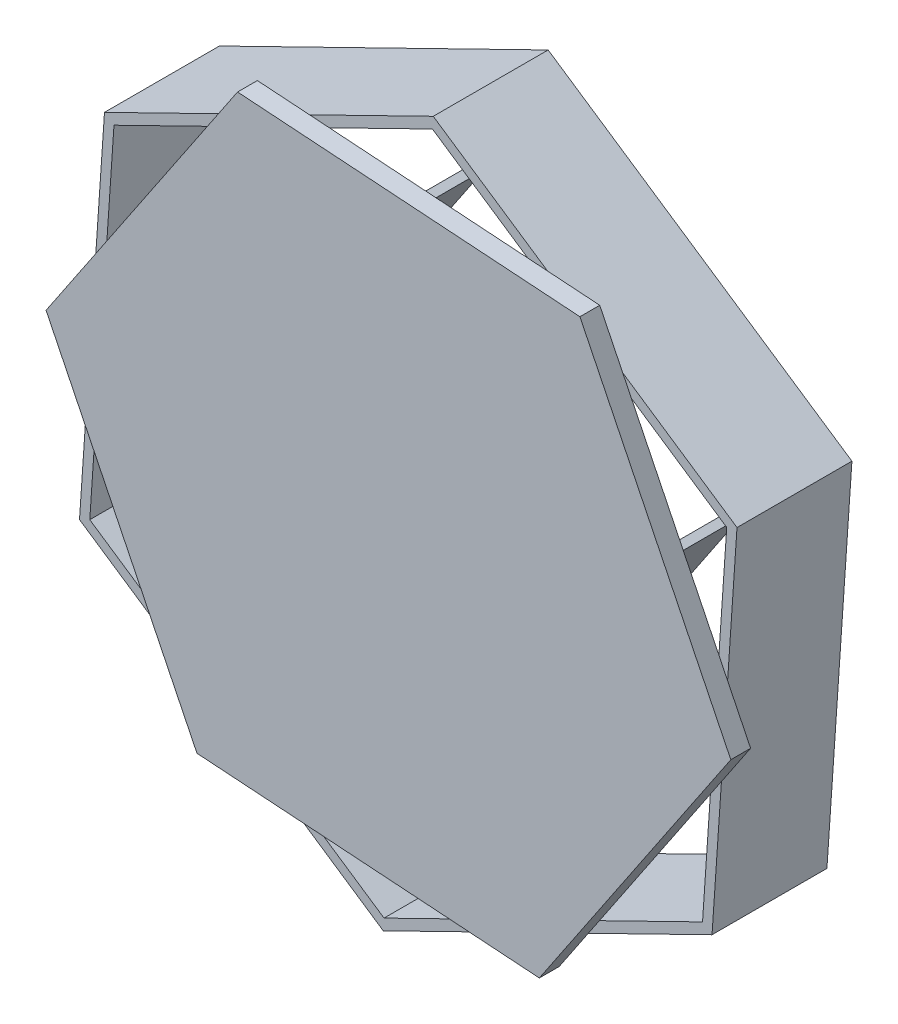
ISO-10303-21;
HEADER;
FILE_DESCRIPTION(('STEP AP214'),'2;1');
FILE_NAME('part.step','',(''),(''),'','','');
FILE_SCHEMA(('AUTOMOTIVE_DESIGN { 1 0 10303 214 1 1 1 1 }'));
ENDSEC;
DATA;
#1=APPLICATION_CONTEXT('core data for automotive mechanical design processes');
#2=APPLICATION_PROTOCOL_DEFINITION('international standard','automotive_design',2000,#1);
#3=PRODUCT_CONTEXT('',#1,'mechanical');
#4=PRODUCT('Part','Part','',(#3));
#5=PRODUCT_RELATED_PRODUCT_CATEGORY('part','',(#4));
#6=PRODUCT_DEFINITION_FORMATION('','',#4);
#7=PRODUCT_DEFINITION_CONTEXT('part definition',#1,'design');
#8=PRODUCT_DEFINITION('design','',#6,#7);
#9=PRODUCT_DEFINITION_SHAPE('','',#8);
#10=(LENGTH_UNIT() NAMED_UNIT(*) SI_UNIT(.MILLI.,.METRE.));
#11=(NAMED_UNIT(*) PLANE_ANGLE_UNIT() SI_UNIT($,.RADIAN.));
#12=(NAMED_UNIT(*) SI_UNIT($,.STERADIAN.) SOLID_ANGLE_UNIT());
#13=UNCERTAINTY_MEASURE_WITH_UNIT(LENGTH_MEASURE(1.E-05),#10,'distance_accuracy_value','');
#14=(GEOMETRIC_REPRESENTATION_CONTEXT(3) GLOBAL_UNCERTAINTY_ASSIGNED_CONTEXT((#13)) GLOBAL_UNIT_ASSIGNED_CONTEXT((#10,
#11,#12)) REPRESENTATION_CONTEXT('',''));
#15=CARTESIAN_POINT('',(0.,0.,0.));
#16=DIRECTION('',(0.,0.,1.));
#17=DIRECTION('',(1.,0.,0.));
#18=AXIS2_PLACEMENT_3D('',#15,#16,#17);
#19=CARTESIAN_POINT('',(0.,0.,-6.35));
#20=DIRECTION('',(0.,0.,1.));
#21=DIRECTION('',(1.,0.,0.));
#22=AXIS2_PLACEMENT_3D('',#19,#20,#21);
#23=PLANE('',#22);
#24=DIRECTION('',(-0.829870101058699,0.557956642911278,0.));
#25=VECTOR('',#24,1.);
#26=CARTESIAN_POINT('',(-37.9193364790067,-58.6750314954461,-6.35));
#27=LINE('',#26,#25);
#28=CARTESIAN_POINT('',(-37.9193364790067,-58.6750314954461,-6.35));
#29=VERTEX_POINT('',#28);
#30=CARTESIAN_POINT('',(-40.0272065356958,-57.2578216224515,-6.35));
#31=VERTEX_POINT('',#30);
#32=EDGE_CURVE('E370',#29,#31,#27,.T.);
#33=ORIENTED_EDGE('',*,*,#32,.F.);
#34=DIRECTION('',(-0.557956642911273,-0.829870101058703,0.));
#35=VECTOR('',#34,1.);
#36=CARTESIAN_POINT('',(-37.9193364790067,-58.6750314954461,-6.35));
#37=LINE('',#36,#35);
#38=CARTESIAN_POINT('',(40.0272065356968,57.2578216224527,-6.35));
#39=VERTEX_POINT('',#38);
#40=EDGE_CURVE('E359',#39,#29,#37,.T.);
#41=ORIENTED_EDGE('',*,*,#40,.F.);
#42=DIRECTION('',(0.829870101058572,-0.557956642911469,0.));
#43=VECTOR('',#42,1.);
#44=CARTESIAN_POINT('',(40.0272065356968,57.2578216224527,-6.35));
#45=LINE('',#44,#43);
#46=CARTESIAN_POINT('',(37.9193364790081,58.6750314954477,-6.35));
#47=VERTEX_POINT('',#46);
#48=EDGE_CURVE('E358',#47,#39,#45,.T.);
#49=ORIENTED_EDGE('',*,*,#48,.F.);
#50=DIRECTION('',(0.557956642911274,0.829870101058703,0.));
#51=VECTOR('',#50,1.);
#52=CARTESIAN_POINT('',(37.9193364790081,58.6750314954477,-6.35));
#53=LINE('',#52,#51);
#54=EDGE_CURVE('E365',#31,#47,#53,.T.);
#55=ORIENTED_EDGE('',*,*,#54,.F.);
#56=EDGE_LOOP('',(#33,#41,#49,#55));
#57=FACE_BOUND('',#56,.T.);
#58=DIRECTION('',(0.43971026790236,-0.898139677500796,0.));
#59=VECTOR('',#58,1.);
#60=CARTESIAN_POINT('',(-109.728620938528,7.50864481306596,-6.35));
#61=LINE('',#60,#59);
#62=CARTESIAN_POINT('',(-99.5623205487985,-13.2567509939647,-6.35));
#63=VERTEX_POINT('',#62);
#64=CARTESIAN_POINT('',(-71.5332880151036,-70.5080550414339,-6.35));
#65=VERTEX_POINT('',#64);
#66=EDGE_CURVE('E696',#63,#65,#61,.T.);
#67=ORIENTED_EDGE('',*,*,#66,.F.);
#68=DIRECTION('',(0.0682695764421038,0.997666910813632,0.));
#69=VECTOR('',#68,1.);
#70=CARTESIAN_POINT('',(-102.074832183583,-49.9736877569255,-6.35));
#71=LINE('',#70,#69);
#72=CARTESIAN_POINT('',(-96.828410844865,26.6956171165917,-6.35));
#73=VERTEX_POINT('',#72);
#74=EDGE_CURVE('E467',#63,#73,#71,.T.);
#75=ORIENTED_EDGE('',*,*,#74,.T.);
#76=DIRECTION('',(-0.557956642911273,-0.829870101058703,0.));
#77=VECTOR('',#76,1.);
#78=CARTESIAN_POINT('',(-48.3616333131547,98.7820956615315,-6.35));
#79=LINE('',#78,#77);
#80=CARTESIAN_POINT('',(-61.2618434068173,79.5951233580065,-6.35));
#81=VERTEX_POINT('',#80);
#82=EDGE_CURVE('E753',#81,#73,#79,.T.);
#83=ORIENTED_EDGE('',*,*,#82,.F.);
#84=DIRECTION('',(0.898139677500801,0.439710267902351,0.));
#85=VECTOR('',#84,1.);
#86=CARTESIAN_POINT('',(-94.3158992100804,63.4125538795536,-6.35));
#87=LINE('',#86,#85);
#88=CARTESIAN_POINT('',(-25.2951228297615,97.2036721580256,-6.35));
#89=VERTEX_POINT('',#88);
#90=EDGE_CURVE('E473',#81,#89,#87,.T.);
#91=ORIENTED_EDGE('',*,*,#90,.T.);
#92=DIRECTION('',(-0.997666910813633,0.0682695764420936,0.));
#93=VECTOR('',#92,1.);
#94=CARTESIAN_POINT('',(61.3669876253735,91.2734508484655,-6.35));
#95=LINE('',#94,#93);
#96=CARTESIAN_POINT('',(38.300477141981,92.8518743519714,-6.35));
#97=VERTEX_POINT('',#96);
#98=EDGE_CURVE('E778',#97,#89,#95,.T.);
#99=ORIENTED_EDGE('',*,*,#98,.F.);
#100=DIRECTION('',(0.829870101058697,-0.557956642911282,0.));
#101=VECTOR('',#100,1.);
#102=CARTESIAN_POINT('',(7.75893297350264,113.386241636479,-6.35));
#103=LINE('',#102,#101);
#104=CARTESIAN_POINT('',(71.5332880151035,70.508055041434,-6.35));
#105=VERTEX_POINT('',#104);
#106=EDGE_CURVE('E478',#97,#105,#103,.T.);
#107=ORIENTED_EDGE('',*,*,#106,.T.);
#108=DIRECTION('',(-0.43971026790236,0.898139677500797,0.));
#109=VECTOR('',#108,1.);
#110=CARTESIAN_POINT('',(109.728620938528,-7.50864481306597,-6.35));
#111=LINE('',#110,#109);
#112=CARTESIAN_POINT('',(99.5623205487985,13.2567509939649,-6.35));
#113=VERTEX_POINT('',#112);
#114=EDGE_CURVE('E677',#113,#105,#111,.T.);
#115=ORIENTED_EDGE('',*,*,#114,.F.);
#116=DIRECTION('',(-0.0682695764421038,-0.997666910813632,0.));
#117=VECTOR('',#116,1.);
#118=CARTESIAN_POINT('',(102.074832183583,49.9736877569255,-6.35));
#119=LINE('',#118,#117);
#120=CARTESIAN_POINT('',(96.828410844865,-26.6956171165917,-6.35));
#121=VERTEX_POINT('',#120);
#122=EDGE_CURVE('E481',#113,#121,#119,.T.);
#123=ORIENTED_EDGE('',*,*,#122,.T.);
#124=DIRECTION('',(0.557956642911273,0.829870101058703,0.));
#125=VECTOR('',#124,1.);
#126=CARTESIAN_POINT('',(48.3616333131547,-98.7820956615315,-6.35));
#127=LINE('',#126,#125);
#128=CARTESIAN_POINT('',(61.2618434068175,-79.5951233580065,-6.35));
#129=VERTEX_POINT('',#128);
#130=EDGE_CURVE('E669',#129,#121,#127,.T.);
#131=ORIENTED_EDGE('',*,*,#130,.F.);
#132=DIRECTION('',(-0.898139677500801,-0.439710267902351,0.));
#133=VECTOR('',#132,1.);
#134=CARTESIAN_POINT('',(94.3158992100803,-63.4125538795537,-6.35));
#135=LINE('',#134,#133);
#136=CARTESIAN_POINT('',(25.2951228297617,-97.2036721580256,-6.35));
#137=VERTEX_POINT('',#136);
#138=EDGE_CURVE('E486',#129,#137,#135,.T.);
#139=ORIENTED_EDGE('',*,*,#138,.T.);
#140=DIRECTION('',(0.997666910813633,-0.0682695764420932,0.));
#141=VECTOR('',#140,1.);
#142=CARTESIAN_POINT('',(-61.3669876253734,-91.2734508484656,-6.35));
#143=LINE('',#142,#141);
#144=CARTESIAN_POINT('',(-38.3004771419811,-92.8518743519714,-6.35));
#145=VERTEX_POINT('',#144);
#146=EDGE_CURVE('E697',#145,#137,#143,.T.);
#147=ORIENTED_EDGE('',*,*,#146,.F.);
#148=DIRECTION('',(-0.829870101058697,0.557956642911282,0.));
#149=VECTOR('',#148,1.);
#150=CARTESIAN_POINT('',(-7.75893297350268,-113.386241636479,-6.35));
#151=LINE('',#150,#149);
#152=EDGE_CURVE('E487',#145,#65,#151,.T.);
#153=ORIENTED_EDGE('',*,*,#152,.T.);
#154=EDGE_LOOP('',(#67,#75,#83,#91,#99,#107,#115,#123,#131,#139,#147,#153));
#155=FACE_BOUND('',#154,.T.);
#156=DIRECTION('',(-0.557956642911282,-0.829870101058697,0.));
#157=VECTOR('',#156,1.);
#158=CARTESIAN_POINT('',(3.18412962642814,-86.3106240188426,-6.35));
#159=LINE('',#158,#157);
#160=CARTESIAN_POINT('',(81.1306726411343,29.6222290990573,-6.35));
#161=VERTEX_POINT('',#160);
#162=CARTESIAN_POINT('',(3.18412962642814,-86.3106240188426,-6.35));
#163=VERTEX_POINT('',#162);
#164=EDGE_CURVE('E367',#161,#163,#159,.T.);
#165=ORIENTED_EDGE('',*,*,#164,.F.);
#166=DIRECTION('',(0.829870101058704,-0.557956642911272,0.));
#167=VECTOR('',#166,1.);
#168=CARTESIAN_POINT('',(81.1306726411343,29.6222290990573,-6.35));
#169=LINE('',#168,#167);
#170=CARTESIAN_POINT('',(79.0228025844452,31.0394389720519,-6.35));
#171=VERTEX_POINT('',#170);
#172=EDGE_CURVE('E385',#171,#161,#169,.T.);
#173=ORIENTED_EDGE('',*,*,#172,.F.);
#174=DIRECTION('',(0.557956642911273,0.829870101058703,0.));
#175=VECTOR('',#174,1.);
#176=CARTESIAN_POINT('',(79.0228025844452,31.0394389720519,-6.35));
#177=LINE('',#176,#175);
#178=CARTESIAN_POINT('',(1.07625956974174,-84.8934141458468,-6.35));
#179=VERTEX_POINT('',#178);
#180=EDGE_CURVE('E393',#179,#171,#177,.T.);
#181=ORIENTED_EDGE('',*,*,#180,.F.);
#182=DIRECTION('',(-0.829870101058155,0.557956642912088,0.));
#183=VECTOR('',#182,1.);
#184=CARTESIAN_POINT('',(3.18412962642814,-86.3106240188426,-6.35));
#185=LINE('',#184,#183);
#186=EDGE_CURVE('E394',#163,#179,#185,.T.);
#187=ORIENTED_EDGE('',*,*,#186,.F.);
#188=EDGE_LOOP('',(#165,#173,#181,#187));
#189=FACE_BOUND('',#188,.T.);
#190=DIRECTION('',(0.557956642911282,0.829870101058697,0.));
#191=VECTOR('',#190,1.);
#192=CARTESIAN_POINT('',(-3.18412962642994,86.3106240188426,-6.35));
#193=LINE('',#192,#191);
#194=CARTESIAN_POINT('',(-81.1306726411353,-29.6222290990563,-6.35));
#195=VERTEX_POINT('',#194);
#196=CARTESIAN_POINT('',(-3.18412962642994,86.3106240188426,-6.35));
#197=VERTEX_POINT('',#196);
#198=EDGE_CURVE('E309',#195,#197,#193,.T.);
#199=ORIENTED_EDGE('',*,*,#198,.F.);
#200=DIRECTION('',(-0.829870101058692,0.55795664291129,0.));
#201=VECTOR('',#200,1.);
#202=CARTESIAN_POINT('',(-79.0228025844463,-31.039438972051,-6.35));
#203=LINE('',#202,#201);
#204=CARTESIAN_POINT('',(-79.0228025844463,-31.039438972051,-6.35));
#205=VERTEX_POINT('',#204);
#206=EDGE_CURVE('E315',#205,#195,#203,.T.);
#207=ORIENTED_EDGE('',*,*,#206,.F.);
#208=DIRECTION('',(-0.557956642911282,-0.829870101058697,0.));
#209=VECTOR('',#208,1.);
#210=CARTESIAN_POINT('',(-79.0228025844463,-31.039438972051,-6.35));
#211=LINE('',#210,#209);
#212=CARTESIAN_POINT('',(-1.07625956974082,84.8934141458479,-6.35));
#213=VERTEX_POINT('',#212);
#214=EDGE_CURVE('E62',#213,#205,#211,.T.);
#215=ORIENTED_EDGE('',*,*,#214,.F.);
#216=DIRECTION('',(0.829870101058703,-0.557956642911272,0.));
#217=VECTOR('',#216,1.);
#218=CARTESIAN_POINT('',(-1.07625956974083,84.8934141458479,-6.35));
#219=LINE('',#218,#217);
#220=EDGE_CURVE('E58',#197,#213,#219,.T.);
#221=ORIENTED_EDGE('',*,*,#220,.F.);
#222=EDGE_LOOP('',(#199,#207,#215,#221));
#223=FACE_BOUND('',#222,.T.);
#224=ADVANCED_FACE('F41',(#57,#155,#189,#223),#23,.F.);
#225=DIRECTION('',(0.0682695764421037,0.997666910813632,0.));
#226=VECTOR('',#225,1.);
#227=CARTESIAN_POINT('',(-105.367568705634,-51.5857422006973,-6.35));
#228=LINE('',#227,#226);
#229=CARTESIAN_POINT('',(-102.354480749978,-7.55356404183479,-6.35));
#230=VERTEX_POINT('',#229);
#231=CARTESIAN_POINT('',(-100.371435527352,21.4259419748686,-6.35));
#232=VERTEX_POINT('',#231);
#233=EDGE_CURVE('E11',#230,#232,#228,.T.);
#234=ORIENTED_EDGE('',*,*,#233,.F.);
#235=CARTESIAN_POINT('',(-109.728620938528,7.50864481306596,-6.35));
#236=VERTEX_POINT('',#235);
#237=EDGE_CURVE('E578',#236,#230,#61,.T.);
#238=ORIENTED_EDGE('',*,*,#237,.F.);
#239=EDGE_CURVE('E575',#232,#236,#79,.T.);
#240=ORIENTED_EDGE('',*,*,#239,.F.);
#241=EDGE_LOOP('',(#234,#238,#240));
#242=FACE_BOUND('',#241,.T.);
#243=ADVANCED_FACE('F796',(#242),#23,.F.);
#244=DIRECTION('',(-0.829870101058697,0.557956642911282,0.));
#245=VECTOR('',#244,1.);
#246=CARTESIAN_POINT('',(-8.00922113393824,-117.04386233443,-6.35));
#247=LINE('',#246,#245);
#248=CARTESIAN_POINT('',(-44.6356620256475,-92.4183625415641,-6.35));
#249=VERTEX_POINT('',#248);
#250=CARTESIAN_POINT('',(-68.7411278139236,-76.2112419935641,-6.35));
#251=VERTEX_POINT('',#250);
#252=EDGE_CURVE('E49',#249,#251,#247,.T.);
#253=ORIENTED_EDGE('',*,*,#252,.F.);
#254=CARTESIAN_POINT('',(-61.3669876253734,-91.2734508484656,-6.35));
#255=VERTEX_POINT('',#254);
#256=EDGE_CURVE('E584',#255,#249,#143,.T.);
#257=ORIENTED_EDGE('',*,*,#256,.F.);
#258=EDGE_CURVE('E580',#251,#255,#61,.T.);
#259=ORIENTED_EDGE('',*,*,#258,.F.);
#260=EDGE_LOOP('',(#253,#257,#259));
#261=FACE_BOUND('',#260,.T.);
#262=ADVANCED_FACE('F713',(#261),#23,.F.);
#263=DIRECTION('',(-0.898139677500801,-0.439710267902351,0.));
#264=VECTOR('',#263,1.);
#265=CARTESIAN_POINT('',(97.3583475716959,-65.4581201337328,-6.35));
#266=LINE('',#265,#264);
#267=CARTESIAN_POINT('',(57.7188187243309,-84.8647984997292,-6.35));
#268=VERTEX_POINT('',#267);
#269=CARTESIAN_POINT('',(31.6303077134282,-97.6371839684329,-6.35));
#270=VERTEX_POINT('',#269);
#271=EDGE_CURVE('E543',#268,#270,#266,.T.);
#272=ORIENTED_EDGE('',*,*,#271,.F.);
#273=CARTESIAN_POINT('',(48.3616333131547,-98.7820956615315,-6.35));
#274=VERTEX_POINT('',#273);
#275=EDGE_CURVE('E587',#274,#268,#127,.T.);
#276=ORIENTED_EDGE('',*,*,#275,.F.);
#277=EDGE_CURVE('E581',#270,#274,#143,.T.);
#278=ORIENTED_EDGE('',*,*,#277,.F.);
#279=EDGE_LOOP('',(#272,#276,#278));
#280=FACE_BOUND('',#279,.T.);
#281=ADVANCED_FACE('F819',(#280),#23,.F.);
#282=DIRECTION('',(-0.0682695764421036,-0.997666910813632,0.));
#283=VECTOR('',#282,1.);
#284=CARTESIAN_POINT('',(105.367568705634,51.5857422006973,-6.35));
#285=LINE('',#284,#283);
#286=CARTESIAN_POINT('',(102.354480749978,7.55356404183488,-6.35));
#287=VERTEX_POINT('',#286);
#288=CARTESIAN_POINT('',(100.371435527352,-21.4259419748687,-6.35));
#289=VERTEX_POINT('',#288);
#290=EDGE_CURVE('E538',#287,#289,#285,.T.);
#291=ORIENTED_EDGE('',*,*,#290,.F.);
#292=CARTESIAN_POINT('',(109.728620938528,-7.50864481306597,-6.35));
#293=VERTEX_POINT('',#292);
#294=EDGE_CURVE('E561',#293,#287,#111,.T.);
#295=ORIENTED_EDGE('',*,*,#294,.F.);
#296=EDGE_CURVE('E586',#289,#293,#127,.T.);
#297=ORIENTED_EDGE('',*,*,#296,.F.);
#298=EDGE_LOOP('',(#291,#295,#297));
#299=FACE_BOUND('',#298,.T.);
#300=ADVANCED_FACE('F642',(#299),#23,.F.);
#301=DIRECTION('',(0.829870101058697,-0.557956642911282,0.));
#302=VECTOR('',#301,1.);
#303=CARTESIAN_POINT('',(8.00922113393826,117.04386233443,-6.35));
#304=LINE('',#303,#302);
#305=CARTESIAN_POINT('',(44.6356620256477,92.418362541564,-6.35));
#306=VERTEX_POINT('',#305);
#307=CARTESIAN_POINT('',(68.7411278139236,76.2112419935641,-6.35));
#308=VERTEX_POINT('',#307);
#309=EDGE_CURVE('E531',#306,#308,#304,.T.);
#310=ORIENTED_EDGE('',*,*,#309,.F.);
#311=CARTESIAN_POINT('',(61.3669876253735,91.2734508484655,-6.35));
#312=VERTEX_POINT('',#311);
#313=EDGE_CURVE('E568',#312,#306,#95,.T.);
#314=ORIENTED_EDGE('',*,*,#313,.F.);
#315=EDGE_CURVE('E569',#308,#312,#111,.T.);
#316=ORIENTED_EDGE('',*,*,#315,.F.);
#317=EDGE_LOOP('',(#310,#314,#316));
#318=FACE_BOUND('',#317,.T.);
#319=ADVANCED_FACE('F811',(#318),#23,.F.);
#320=DIRECTION('',(0.898139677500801,0.439710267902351,0.));
#321=VECTOR('',#320,1.);
#322=CARTESIAN_POINT('',(-97.3583475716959,65.4581201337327,-6.35));
#323=LINE('',#322,#321);
#324=CARTESIAN_POINT('',(-57.7188187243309,84.8647984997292,-6.35));
#325=VERTEX_POINT('',#324);
#326=CARTESIAN_POINT('',(-31.6303077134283,97.6371839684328,-6.35));
#327=VERTEX_POINT('',#326);
#328=EDGE_CURVE('E526',#325,#327,#323,.T.);
#329=ORIENTED_EDGE('',*,*,#328,.F.);
#330=CARTESIAN_POINT('',(-48.3616333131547,98.7820956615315,-6.35));
#331=VERTEX_POINT('',#330);
#332=EDGE_CURVE('E572',#331,#325,#79,.T.);
#333=ORIENTED_EDGE('',*,*,#332,.F.);
#334=EDGE_CURVE('E570',#327,#331,#95,.T.);
#335=ORIENTED_EDGE('',*,*,#334,.F.);
#336=EDGE_LOOP('',(#329,#333,#335));
#337=FACE_BOUND('',#336,.T.);
#338=ADVANCED_FACE('F765',(#337),#23,.F.);
#339=CARTESIAN_POINT('',(109.728620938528,-7.50864481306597,-6.35));
#340=DIRECTION('',(0.898139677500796,0.43971026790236,0.));
#341=DIRECTION('',(-0.43971026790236,0.898139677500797,0.));
#342=AXIS2_PLACEMENT_3D('',#339,#340,#341);
#343=PLANE('',#342);
#344=DIRECTION('',(-0.43971026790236,0.898139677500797,0.));
#345=VECTOR('',#344,1.);
#346=CARTESIAN_POINT('',(109.728620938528,-7.50864481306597,0.));
#347=LINE('',#346,#345);
#348=CARTESIAN_POINT('',(109.728620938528,-7.50864481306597,0.));
#349=VERTEX_POINT('',#348);
#350=CARTESIAN_POINT('',(61.3669876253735,91.2734508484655,0.));
#351=VERTEX_POINT('',#350);
#352=EDGE_CURVE('E565',#349,#351,#347,.T.);
#353=ORIENTED_EDGE('',*,*,#352,.F.);
#354=DIRECTION('',(0.,0.,1.));
#355=VECTOR('',#354,1.);
#356=CARTESIAN_POINT('',(109.728620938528,-7.50864481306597,-6.35));
#357=LINE('',#356,#355);
#358=EDGE_CURVE('E614',#293,#349,#357,.T.);
#359=ORIENTED_EDGE('',*,*,#358,.F.);
#360=ORIENTED_EDGE('',*,*,#294,.T.);
#361=EDGE_CURVE('E566',#287,#113,#111,.T.);
#362=ORIENTED_EDGE('',*,*,#361,.T.);
#363=ORIENTED_EDGE('',*,*,#114,.T.);
#364=EDGE_CURVE('E781',#105,#308,#111,.T.);
#365=ORIENTED_EDGE('',*,*,#364,.T.);
#366=ORIENTED_EDGE('',*,*,#315,.T.);
#367=DIRECTION('',(0.,0.,1.));
#368=VECTOR('',#367,1.);
#369=CARTESIAN_POINT('',(61.3669876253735,91.2734508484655,-6.35));
#370=LINE('',#369,#368);
#371=EDGE_CURVE('E44',#312,#351,#370,.T.);
#372=ORIENTED_EDGE('',*,*,#371,.T.);
#373=EDGE_LOOP('',(#353,#359,#360,#362,#363,#365,#366,#372));
#374=FACE_BOUND('',#373,.T.);
#375=ADVANCED_FACE('F43',(#374),#343,.T.);
#376=CARTESIAN_POINT('',(48.3616333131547,-98.7820956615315,-6.35));
#377=DIRECTION('',(0.829870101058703,-0.557956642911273,0.));
#378=DIRECTION('',(0.557956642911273,0.829870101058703,0.));
#379=AXIS2_PLACEMENT_3D('',#376,#377,#378);
#380=PLANE('',#379);
#381=DIRECTION('',(0.557956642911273,0.829870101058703,0.));
#382=VECTOR('',#381,1.);
#383=CARTESIAN_POINT('',(48.3616333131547,-98.7820956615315,0.));
#384=LINE('',#383,#382);
#385=CARTESIAN_POINT('',(48.3616333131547,-98.7820956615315,0.));
#386=VERTEX_POINT('',#385);
#387=EDGE_CURVE('E609',#386,#349,#384,.T.);
#388=ORIENTED_EDGE('',*,*,#387,.F.);
#389=DIRECTION('',(0.,0.,1.));
#390=VECTOR('',#389,1.);
#391=CARTESIAN_POINT('',(48.3616333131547,-98.7820956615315,-6.35));
#392=LINE('',#391,#390);
#393=EDGE_CURVE('E615',#274,#386,#392,.T.);
#394=ORIENTED_EDGE('',*,*,#393,.F.);
#395=ORIENTED_EDGE('',*,*,#275,.T.);
#396=EDGE_CURVE('E593',#268,#129,#127,.T.);
#397=ORIENTED_EDGE('',*,*,#396,.T.);
#398=ORIENTED_EDGE('',*,*,#130,.T.);
#399=EDGE_CURVE('E666',#121,#289,#127,.T.);
#400=ORIENTED_EDGE('',*,*,#399,.T.);
#401=ORIENTED_EDGE('',*,*,#296,.T.);
#402=ORIENTED_EDGE('',*,*,#358,.T.);
#403=EDGE_LOOP('',(#388,#394,#395,#397,#398,#400,#401,#402));
#404=FACE_BOUND('',#403,.T.);
#405=ADVANCED_FACE('F637',(#404),#380,.T.);
#406=CARTESIAN_POINT('',(-61.3669876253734,-91.2734508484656,-6.35));
#407=DIRECTION('',(-0.0682695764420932,-0.997666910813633,0.));
#408=DIRECTION('',(0.997666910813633,-0.0682695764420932,0.));
#409=AXIS2_PLACEMENT_3D('',#406,#407,#408);
#410=PLANE('',#409);
#411=DIRECTION('',(0.997666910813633,-0.0682695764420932,0.));
#412=VECTOR('',#411,1.);
#413=CARTESIAN_POINT('',(-61.3669876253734,-91.2734508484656,0.));
#414=LINE('',#413,#412);
#415=CARTESIAN_POINT('',(-61.3669876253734,-91.2734508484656,0.));
#416=VERTEX_POINT('',#415);
#417=EDGE_CURVE('E604',#416,#386,#414,.T.);
#418=ORIENTED_EDGE('',*,*,#417,.F.);
#419=DIRECTION('',(0.,0.,1.));
#420=VECTOR('',#419,1.);
#421=CARTESIAN_POINT('',(-61.3669876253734,-91.2734508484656,-6.35));
#422=LINE('',#421,#420);
#423=EDGE_CURVE('E612',#255,#416,#422,.T.);
#424=ORIENTED_EDGE('',*,*,#423,.F.);
#425=ORIENTED_EDGE('',*,*,#256,.T.);
#426=EDGE_CURVE('E589',#249,#145,#143,.T.);
#427=ORIENTED_EDGE('',*,*,#426,.T.);
#428=ORIENTED_EDGE('',*,*,#146,.T.);
#429=EDGE_CURVE('E689',#137,#270,#143,.T.);
#430=ORIENTED_EDGE('',*,*,#429,.T.);
#431=ORIENTED_EDGE('',*,*,#277,.T.);
#432=ORIENTED_EDGE('',*,*,#393,.T.);
#433=EDGE_LOOP('',(#418,#424,#425,#427,#428,#430,#431,#432));
#434=FACE_BOUND('',#433,.T.);
#435=ADVANCED_FACE('F712',(#434),#410,.T.);
#436=CARTESIAN_POINT('',(-109.728620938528,7.50864481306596,-6.35));
#437=DIRECTION('',(-0.898139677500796,-0.43971026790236,0.));
#438=DIRECTION('',(0.43971026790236,-0.898139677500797,0.));
#439=AXIS2_PLACEMENT_3D('',#436,#437,#438);
#440=PLANE('',#439);
#441=DIRECTION('',(0.43971026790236,-0.898139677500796,0.));
#442=VECTOR('',#441,1.);
#443=CARTESIAN_POINT('',(-109.728620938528,7.50864481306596,0.));
#444=LINE('',#443,#442);
#445=CARTESIAN_POINT('',(-109.728620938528,7.50864481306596,0.));
#446=VERTEX_POINT('',#445);
#447=EDGE_CURVE('E605',#446,#416,#444,.T.);
#448=ORIENTED_EDGE('',*,*,#447,.F.);
#449=DIRECTION('',(0.,0.,1.));
#450=VECTOR('',#449,1.);
#451=CARTESIAN_POINT('',(-109.728620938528,7.50864481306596,-6.35));
#452=LINE('',#451,#450);
#453=EDGE_CURVE('E619',#236,#446,#452,.T.);
#454=ORIENTED_EDGE('',*,*,#453,.F.);
#455=ORIENTED_EDGE('',*,*,#237,.T.);
#456=EDGE_CURVE('E585',#230,#63,#61,.T.);
#457=ORIENTED_EDGE('',*,*,#456,.T.);
#458=ORIENTED_EDGE('',*,*,#66,.T.);
#459=EDGE_CURVE('E706',#65,#251,#61,.T.);
#460=ORIENTED_EDGE('',*,*,#459,.T.);
#461=ORIENTED_EDGE('',*,*,#258,.T.);
#462=ORIENTED_EDGE('',*,*,#423,.T.);
#463=EDGE_LOOP('',(#448,#454,#455,#457,#458,#460,#461,#462));
#464=FACE_BOUND('',#463,.T.);
#465=ADVANCED_FACE('F704',(#464),#440,.T.);
#466=CARTESIAN_POINT('',(-48.3616333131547,98.7820956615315,-6.35));
#467=DIRECTION('',(-0.829870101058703,0.557956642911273,0.));
#468=DIRECTION('',(-0.557956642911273,-0.829870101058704,0.));
#469=AXIS2_PLACEMENT_3D('',#466,#467,#468);
#470=PLANE('',#469);
#471=DIRECTION('',(-0.557956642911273,-0.829870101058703,0.));
#472=VECTOR('',#471,1.);
#473=CARTESIAN_POINT('',(-48.3616333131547,98.7820956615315,0.));
#474=LINE('',#473,#472);
#475=CARTESIAN_POINT('',(-48.3616333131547,98.7820956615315,0.));
#476=VERTEX_POINT('',#475);
#477=EDGE_CURVE('E597',#476,#446,#474,.T.);
#478=ORIENTED_EDGE('',*,*,#477,.F.);
#479=DIRECTION('',(0.,0.,1.));
#480=VECTOR('',#479,1.);
#481=CARTESIAN_POINT('',(-48.3616333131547,98.7820956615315,-6.35));
#482=LINE('',#481,#480);
#483=EDGE_CURVE('E620',#331,#476,#482,.T.);
#484=ORIENTED_EDGE('',*,*,#483,.F.);
#485=ORIENTED_EDGE('',*,*,#332,.T.);
#486=EDGE_CURVE('E576',#325,#81,#79,.T.);
#487=ORIENTED_EDGE('',*,*,#486,.T.);
#488=ORIENTED_EDGE('',*,*,#82,.T.);
#489=EDGE_CURVE('E756',#73,#232,#79,.T.);
#490=ORIENTED_EDGE('',*,*,#489,.T.);
#491=ORIENTED_EDGE('',*,*,#239,.T.);
#492=ORIENTED_EDGE('',*,*,#453,.T.);
#493=EDGE_LOOP('',(#478,#484,#485,#487,#488,#490,#491,#492));
#494=FACE_BOUND('',#493,.T.);
#495=ADVANCED_FACE('F760',(#494),#470,.T.);
#496=CARTESIAN_POINT('',(61.3669876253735,91.2734508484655,-6.35));
#497=DIRECTION('',(0.0682695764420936,0.997666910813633,0.));
#498=DIRECTION('',(-0.997666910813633,0.0682695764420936,0.));
#499=AXIS2_PLACEMENT_3D('',#496,#497,#498);
#500=PLANE('',#499);
#501=DIRECTION('',(-0.997666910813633,0.0682695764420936,0.));
#502=VECTOR('',#501,1.);
#503=CARTESIAN_POINT('',(61.3669876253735,91.2734508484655,0.));
#504=LINE('',#503,#502);
#505=EDGE_CURVE('E596',#351,#476,#504,.T.);
#506=ORIENTED_EDGE('',*,*,#505,.F.);
#507=ORIENTED_EDGE('',*,*,#371,.F.);
#508=ORIENTED_EDGE('',*,*,#313,.T.);
#509=EDGE_CURVE('E573',#306,#97,#95,.T.);
#510=ORIENTED_EDGE('',*,*,#509,.T.);
#511=ORIENTED_EDGE('',*,*,#98,.T.);
#512=EDGE_CURVE('E777',#89,#327,#95,.T.);
#513=ORIENTED_EDGE('',*,*,#512,.T.);
#514=ORIENTED_EDGE('',*,*,#334,.T.);
#515=ORIENTED_EDGE('',*,*,#483,.T.);
#516=EDGE_LOOP('',(#506,#507,#508,#510,#511,#513,#514,#515));
#517=FACE_BOUND('',#516,.T.);
#518=ADVANCED_FACE('F627',(#517),#500,.T.);
#519=CARTESIAN_POINT('',(0.,0.,0.));
#520=DIRECTION('',(0.,0.,1.));
#521=DIRECTION('',(1.,0.,0.));
#522=AXIS2_PLACEMENT_3D('',#519,#520,#521);
#523=PLANE('',#522);
#524=ORIENTED_EDGE('',*,*,#352,.T.);
#525=ORIENTED_EDGE('',*,*,#505,.T.);
#526=ORIENTED_EDGE('',*,*,#477,.T.);
#527=ORIENTED_EDGE('',*,*,#447,.T.);
#528=ORIENTED_EDGE('',*,*,#417,.T.);
#529=ORIENTED_EDGE('',*,*,#387,.T.);
#530=EDGE_LOOP('',(#524,#525,#526,#527,#528,#529));
#531=FACE_BOUND('',#530,.T.);
#532=ADVANCED_FACE('F634',(#531),#523,.T.);
#533=CARTESIAN_POINT('',(0.,0.,-6.35));
#534=DIRECTION('',(0.,0.,-1.));
#535=DIRECTION('',(-1.,0.,0.));
#536=AXIS2_PLACEMENT_3D('',#533,#534,#535);
#537=PLANE('',#536);
#538=ORIENTED_EDGE('',*,*,#361,.F.);
#539=CARTESIAN_POINT('',(105.367568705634,51.5857422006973,-6.35));
#540=VERTEX_POINT('',#539);
#541=EDGE_CURVE('E534',#540,#287,#285,.T.);
#542=ORIENTED_EDGE('',*,*,#541,.F.);
#543=EDGE_CURVE('E527',#308,#540,#304,.T.);
#544=ORIENTED_EDGE('',*,*,#543,.F.);
#545=ORIENTED_EDGE('',*,*,#364,.F.);
#546=CARTESIAN_POINT('',(102.074832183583,49.9736877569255,-6.35));
#547=VERTEX_POINT('',#546);
#548=EDGE_CURVE('E468',#105,#547,#103,.T.);
#549=ORIENTED_EDGE('',*,*,#548,.T.);
#550=EDGE_CURVE('E480',#547,#113,#119,.T.);
#551=ORIENTED_EDGE('',*,*,#550,.T.);
#552=EDGE_LOOP('',(#538,#542,#544,#545,#549,#551));
#553=FACE_BOUND('',#552,.T.);
#554=ADVANCED_FACE('F790',(#553),#537,.F.);
#555=ORIENTED_EDGE('',*,*,#396,.F.);
#556=CARTESIAN_POINT('',(97.3583475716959,-65.4581201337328,-6.35));
#557=VERTEX_POINT('',#556);
#558=EDGE_CURVE('E537',#557,#268,#266,.T.);
#559=ORIENTED_EDGE('',*,*,#558,.F.);
#560=EDGE_CURVE('E535',#289,#557,#285,.T.);
#561=ORIENTED_EDGE('',*,*,#560,.F.);
#562=ORIENTED_EDGE('',*,*,#399,.F.);
#563=CARTESIAN_POINT('',(94.3158992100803,-63.4125538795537,-6.35));
#564=VERTEX_POINT('',#563);
#565=EDGE_CURVE('E474',#121,#564,#119,.T.);
#566=ORIENTED_EDGE('',*,*,#565,.T.);
#567=EDGE_CURVE('E485',#564,#129,#135,.T.);
#568=ORIENTED_EDGE('',*,*,#567,.T.);
#569=EDGE_LOOP('',(#555,#559,#561,#562,#566,#568));
#570=FACE_BOUND('',#569,.T.);
#571=ADVANCED_FACE('F662',(#570),#537,.F.);
#572=ORIENTED_EDGE('',*,*,#426,.F.);
#573=CARTESIAN_POINT('',(-8.00922113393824,-117.04386233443,-6.35));
#574=VERTEX_POINT('',#573);
#575=EDGE_CURVE('E512',#574,#249,#247,.T.);
#576=ORIENTED_EDGE('',*,*,#575,.F.);
#577=EDGE_CURVE('E540',#270,#574,#266,.T.);
#578=ORIENTED_EDGE('',*,*,#577,.F.);
#579=ORIENTED_EDGE('',*,*,#429,.F.);
#580=CARTESIAN_POINT('',(-7.75893297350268,-113.386241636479,-6.35));
#581=VERTEX_POINT('',#580);
#582=EDGE_CURVE('E477',#137,#581,#135,.T.);
#583=ORIENTED_EDGE('',*,*,#582,.T.);
#584=EDGE_CURVE('E447',#581,#145,#151,.T.);
#585=ORIENTED_EDGE('',*,*,#584,.T.);
#586=EDGE_LOOP('',(#572,#576,#578,#579,#583,#585));
#587=FACE_BOUND('',#586,.T.);
#588=ADVANCED_FACE('F683',(#587),#537,.F.);
#589=ORIENTED_EDGE('',*,*,#456,.F.);
#590=CARTESIAN_POINT('',(-105.367568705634,-51.5857422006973,-6.35));
#591=VERTEX_POINT('',#590);
#592=EDGE_CURVE('E55',#591,#230,#228,.T.);
#593=ORIENTED_EDGE('',*,*,#592,.F.);
#594=EDGE_CURVE('E545',#251,#591,#247,.T.);
#595=ORIENTED_EDGE('',*,*,#594,.F.);
#596=ORIENTED_EDGE('',*,*,#459,.F.);
#597=CARTESIAN_POINT('',(-102.074832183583,-49.9736877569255,-6.35));
#598=VERTEX_POINT('',#597);
#599=EDGE_CURVE('E484',#65,#598,#151,.T.);
#600=ORIENTED_EDGE('',*,*,#599,.T.);
#601=EDGE_CURVE('E461',#598,#63,#71,.T.);
#602=ORIENTED_EDGE('',*,*,#601,.T.);
#603=EDGE_LOOP('',(#589,#593,#595,#596,#600,#602));
#604=FACE_BOUND('',#603,.T.);
#605=ADVANCED_FACE('F729',(#604),#537,.F.);
#606=ORIENTED_EDGE('',*,*,#486,.F.);
#607=CARTESIAN_POINT('',(-97.3583475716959,65.4581201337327,-6.35));
#608=VERTEX_POINT('',#607);
#609=EDGE_CURVE('E521',#608,#325,#323,.T.);
#610=ORIENTED_EDGE('',*,*,#609,.F.);
#611=EDGE_CURVE('E52',#232,#608,#228,.T.);
#612=ORIENTED_EDGE('',*,*,#611,.F.);
#613=ORIENTED_EDGE('',*,*,#489,.F.);
#614=CARTESIAN_POINT('',(-94.3158992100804,63.4125538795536,-6.35));
#615=VERTEX_POINT('',#614);
#616=EDGE_CURVE('E441',#73,#615,#71,.T.);
#617=ORIENTED_EDGE('',*,*,#616,.T.);
#618=EDGE_CURVE('E469',#615,#81,#87,.T.);
#619=ORIENTED_EDGE('',*,*,#618,.T.);
#620=EDGE_LOOP('',(#606,#610,#612,#613,#617,#619));
#621=FACE_BOUND('',#620,.T.);
#622=ADVANCED_FACE('F748',(#621),#537,.F.);
#623=CARTESIAN_POINT('',(0.,0.,-43.18));
#624=DIRECTION('',(0.,0.,-1.));
#625=DIRECTION('',(-1.,0.,0.));
#626=AXIS2_PLACEMENT_3D('',#623,#624,#625);
#627=PLANE('',#626);
#628=CARTESIAN_POINT('',(-43.9765231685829,89.8251944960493,-43.18));
#629=DIRECTION('',(0.,0.,-1.));
#630=DIRECTION('',(-1.,0.,0.));
#631=AXIS2_PLACEMENT_3D('',#628,#629,#630);
#632=CIRCLE('',#631,1.27);
#633=CARTESIAN_POINT('',(-45.2465231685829,89.8251944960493,-43.18));
#634=VERTEX_POINT('',#633);
#635=EDGE_CURVE('E436',#634,#634,#632,.T.);
#636=ORIENTED_EDGE('',*,*,#635,.F.);
#637=EDGE_LOOP('',(#636));
#638=FACE_BOUND('',#637,.T.);
#639=CARTESIAN_POINT('',(-99.7791619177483,6.82781101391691,-43.18));
#640=DIRECTION('',(0.,0.,-1.));
#641=DIRECTION('',(-1.,0.,0.));
#642=AXIS2_PLACEMENT_3D('',#639,#640,#641);
#643=CIRCLE('',#642,1.26999999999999);
#644=CARTESIAN_POINT('',(-101.049161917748,6.82781101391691,-43.18));
#645=VERTEX_POINT('',#644);
#646=EDGE_CURVE('E429',#645,#645,#643,.T.);
#647=ORIENTED_EDGE('',*,*,#646,.F.);
#648=EDGE_LOOP('',(#647));
#649=FACE_BOUND('',#648,.T.);
#650=CARTESIAN_POINT('',(-55.8026387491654,-82.9973834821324,-43.18));
#651=DIRECTION('',(0.,0.,-1.));
#652=DIRECTION('',(-1.,0.,0.));
#653=AXIS2_PLACEMENT_3D('',#650,#651,#652);
#654=CIRCLE('',#653,1.27);
#655=CARTESIAN_POINT('',(-57.0726387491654,-82.9973834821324,-43.18));
#656=VERTEX_POINT('',#655);
#657=EDGE_CURVE('E424',#656,#656,#654,.T.);
#658=ORIENTED_EDGE('',*,*,#657,.F.);
#659=EDGE_LOOP('',(#658));
#660=FACE_BOUND('',#659,.T.);
#661=CARTESIAN_POINT('',(43.9765231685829,-89.8251944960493,-43.18));
#662=DIRECTION('',(0.,0.,-1.));
#663=DIRECTION('',(-1.,0.,0.));
#664=AXIS2_PLACEMENT_3D('',#661,#662,#663);
#665=CIRCLE('',#664,1.27);
#666=CARTESIAN_POINT('',(42.7065231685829,-89.8251944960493,-43.18));
#667=VERTEX_POINT('',#666);
#668=EDGE_CURVE('E416',#667,#667,#665,.T.);
#669=ORIENTED_EDGE('',*,*,#668,.F.);
#670=EDGE_LOOP('',(#669));
#671=FACE_BOUND('',#670,.T.);
#672=CARTESIAN_POINT('',(99.7791619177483,-6.82781101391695,-43.18));
#673=DIRECTION('',(0.,0.,-1.));
#674=DIRECTION('',(-1.,0.,0.));
#675=AXIS2_PLACEMENT_3D('',#672,#673,#674);
#676=CIRCLE('',#675,1.27000000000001);
#677=CARTESIAN_POINT('',(98.5091619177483,-6.82781101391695,-43.18));
#678=VERTEX_POINT('',#677);
#679=EDGE_CURVE('E412',#678,#678,#676,.T.);
#680=ORIENTED_EDGE('',*,*,#679,.F.);
#681=EDGE_LOOP('',(#680));
#682=FACE_BOUND('',#681,.T.);
#683=CARTESIAN_POINT('',(55.8026387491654,82.9973834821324,-43.18));
#684=DIRECTION('',(0.,0.,-1.));
#685=DIRECTION('',(-1.,0.,0.));
#686=AXIS2_PLACEMENT_3D('',#683,#684,#685);
#687=CIRCLE('',#686,1.27);
#688=CARTESIAN_POINT('',(54.5326387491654,82.9973834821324,-43.18));
#689=VERTEX_POINT('',#688);
#690=EDGE_CURVE('E411',#689,#689,#687,.T.);
#691=ORIENTED_EDGE('',*,*,#690,.F.);
#692=EDGE_LOOP('',(#691));
#693=FACE_BOUND('',#692,.T.);
#694=DIRECTION('',(0.0682695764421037,0.997666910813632,0.));
#695=VECTOR('',#694,1.);
#696=CARTESIAN_POINT('',(-105.367568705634,-51.5857422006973,-43.18));
#697=LINE('',#696,#695);
#698=CARTESIAN_POINT('',(-105.367568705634,-51.5857422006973,-43.18));
#699=VERTEX_POINT('',#698);
#700=CARTESIAN_POINT('',(-97.3583475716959,65.4581201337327,-43.18));
#701=VERTEX_POINT('',#700);
#702=EDGE_CURVE('E509',#699,#701,#697,.T.);
#703=ORIENTED_EDGE('',*,*,#702,.T.);
#704=DIRECTION('',(0.898139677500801,0.439710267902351,0.));
#705=VECTOR('',#704,1.);
#706=CARTESIAN_POINT('',(-97.3583475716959,65.4581201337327,-43.18));
#707=LINE('',#706,#705);
#708=CARTESIAN_POINT('',(8.00922113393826,117.04386233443,-43.18));
#709=VERTEX_POINT('',#708);
#710=EDGE_CURVE('E508',#701,#709,#707,.T.);
#711=ORIENTED_EDGE('',*,*,#710,.T.);
#712=DIRECTION('',(0.829870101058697,-0.557956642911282,0.));
#713=VECTOR('',#712,1.);
#714=CARTESIAN_POINT('',(8.00922113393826,117.04386233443,-43.18));
#715=LINE('',#714,#713);
#716=CARTESIAN_POINT('',(105.367568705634,51.5857422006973,-43.18));
#717=VERTEX_POINT('',#716);
#718=EDGE_CURVE('E511',#709,#717,#715,.T.);
#719=ORIENTED_EDGE('',*,*,#718,.T.);
#720=DIRECTION('',(-0.0682695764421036,-0.997666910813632,0.));
#721=VECTOR('',#720,1.);
#722=CARTESIAN_POINT('',(105.367568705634,51.5857422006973,-43.18));
#723=LINE('',#722,#721);
#724=CARTESIAN_POINT('',(97.3583475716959,-65.4581201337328,-43.18));
#725=VERTEX_POINT('',#724);
#726=EDGE_CURVE('E513',#717,#725,#723,.T.);
#727=ORIENTED_EDGE('',*,*,#726,.T.);
#728=DIRECTION('',(-0.898139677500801,-0.439710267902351,0.));
#729=VECTOR('',#728,1.);
#730=CARTESIAN_POINT('',(97.3583475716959,-65.4581201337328,-43.18));
#731=LINE('',#730,#729);
#732=CARTESIAN_POINT('',(-8.00922113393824,-117.04386233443,-43.18));
#733=VERTEX_POINT('',#732);
#734=EDGE_CURVE('E516',#725,#733,#731,.T.);
#735=ORIENTED_EDGE('',*,*,#734,.T.);
#736=DIRECTION('',(-0.829870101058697,0.557956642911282,0.));
#737=VECTOR('',#736,1.);
#738=CARTESIAN_POINT('',(-8.00922113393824,-117.04386233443,-43.18));
#739=LINE('',#738,#737);
#740=EDGE_CURVE('E518',#733,#699,#739,.T.);
#741=ORIENTED_EDGE('',*,*,#740,.T.);
#742=EDGE_LOOP('',(#703,#711,#719,#727,#735,#741));
#743=FACE_BOUND('',#742,.T.);
#744=DIRECTION('',(0.898139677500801,0.439710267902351,0.));
#745=VECTOR('',#744,1.);
#746=CARTESIAN_POINT('',(-94.3158992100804,63.4125538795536,-43.18));
#747=LINE('',#746,#745);
#748=CARTESIAN_POINT('',(-94.3158992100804,63.4125538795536,-43.18));
#749=VERTEX_POINT('',#748);
#750=CARTESIAN_POINT('',(7.75893297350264,113.386241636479,-43.18));
#751=VERTEX_POINT('',#750);
#752=EDGE_CURVE('E448',#749,#751,#747,.T.);
#753=ORIENTED_EDGE('',*,*,#752,.F.);
#754=DIRECTION('',(0.0682695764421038,0.997666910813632,0.));
#755=VECTOR('',#754,1.);
#756=CARTESIAN_POINT('',(-102.074832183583,-49.9736877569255,-43.18));
#757=LINE('',#756,#755);
#758=CARTESIAN_POINT('',(-102.074832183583,-49.9736877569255,-43.18));
#759=VERTEX_POINT('',#758);
#760=EDGE_CURVE('E446',#759,#749,#757,.T.);
#761=ORIENTED_EDGE('',*,*,#760,.F.);
#762=DIRECTION('',(-0.829870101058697,0.557956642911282,0.));
#763=VECTOR('',#762,1.);
#764=CARTESIAN_POINT('',(-7.75893297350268,-113.386241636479,-43.18));
#765=LINE('',#764,#763);
#766=CARTESIAN_POINT('',(-7.75893297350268,-113.386241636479,-43.18));
#767=VERTEX_POINT('',#766);
#768=EDGE_CURVE('E459',#767,#759,#765,.T.);
#769=ORIENTED_EDGE('',*,*,#768,.F.);
#770=DIRECTION('',(-0.898139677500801,-0.439710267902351,0.));
#771=VECTOR('',#770,1.);
#772=CARTESIAN_POINT('',(94.3158992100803,-63.4125538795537,-43.18));
#773=LINE('',#772,#771);
#774=CARTESIAN_POINT('',(94.3158992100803,-63.4125538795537,-43.18));
#775=VERTEX_POINT('',#774);
#776=EDGE_CURVE('E457',#775,#767,#773,.T.);
#777=ORIENTED_EDGE('',*,*,#776,.F.);
#778=DIRECTION('',(-0.0682695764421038,-0.997666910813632,0.));
#779=VECTOR('',#778,1.);
#780=CARTESIAN_POINT('',(102.074832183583,49.9736877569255,-43.18));
#781=LINE('',#780,#779);
#782=CARTESIAN_POINT('',(102.074832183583,49.9736877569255,-43.18));
#783=VERTEX_POINT('',#782);
#784=EDGE_CURVE('E451',#783,#775,#781,.T.);
#785=ORIENTED_EDGE('',*,*,#784,.F.);
#786=DIRECTION('',(0.829870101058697,-0.557956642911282,0.));
#787=VECTOR('',#786,1.);
#788=CARTESIAN_POINT('',(7.75893297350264,113.386241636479,-43.18));
#789=LINE('',#788,#787);
#790=EDGE_CURVE('E454',#751,#783,#789,.T.);
#791=ORIENTED_EDGE('',*,*,#790,.F.);
#792=EDGE_LOOP('',(#753,#761,#769,#777,#785,#791));
#793=FACE_BOUND('',#792,.T.);
#794=ADVANCED_FACE('F733',(#638,#649,#660,#671,#682,#693,#743,#793),#627,.T.);
#795=ORIENTED_EDGE('',*,*,#509,.F.);
#796=CARTESIAN_POINT('',(8.00922113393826,117.04386233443,-6.35));
#797=VERTEX_POINT('',#796);
#798=EDGE_CURVE('E530',#797,#306,#304,.T.);
#799=ORIENTED_EDGE('',*,*,#798,.F.);
#800=EDGE_CURVE('E525',#327,#797,#323,.T.);
#801=ORIENTED_EDGE('',*,*,#800,.F.);
#802=ORIENTED_EDGE('',*,*,#512,.F.);
#803=CARTESIAN_POINT('',(7.75893297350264,113.386241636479,-6.35));
#804=VERTEX_POINT('',#803);
#805=EDGE_CURVE('E462',#89,#804,#87,.T.);
#806=ORIENTED_EDGE('',*,*,#805,.T.);
#807=EDGE_CURVE('E472',#804,#97,#103,.T.);
#808=ORIENTED_EDGE('',*,*,#807,.T.);
#809=EDGE_LOOP('',(#795,#799,#801,#802,#806,#808));
#810=FACE_BOUND('',#809,.T.);
#811=ADVANCED_FACE('F779',(#810),#537,.F.);
#812=CARTESIAN_POINT('',(-105.367568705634,-51.5857422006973,-43.18));
#813=DIRECTION('',(0.997666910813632,-0.0682695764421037,0.));
#814=DIRECTION('',(0.0682695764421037,0.997666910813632,0.));
#815=AXIS2_PLACEMENT_3D('',#812,#813,#814);
#816=PLANE('',#815);
#817=ORIENTED_EDGE('',*,*,#592,.T.);
#818=ORIENTED_EDGE('',*,*,#233,.T.);
#819=ORIENTED_EDGE('',*,*,#611,.T.);
#820=DIRECTION('',(0.,0.,1.));
#821=VECTOR('',#820,1.);
#822=CARTESIAN_POINT('',(-97.3583475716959,65.4581201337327,-43.18));
#823=LINE('',#822,#821);
#824=EDGE_CURVE('E557',#701,#608,#823,.T.);
#825=ORIENTED_EDGE('',*,*,#824,.F.);
#826=ORIENTED_EDGE('',*,*,#702,.F.);
#827=DIRECTION('',(0.,0.,1.));
#828=VECTOR('',#827,1.);
#829=CARTESIAN_POINT('',(-105.367568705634,-51.5857422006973,-43.18));
#830=LINE('',#829,#828);
#831=EDGE_CURVE('E517',#699,#591,#830,.T.);
#832=ORIENTED_EDGE('',*,*,#831,.T.);
#833=EDGE_LOOP('',(#817,#818,#819,#825,#826,#832));
#834=FACE_BOUND('',#833,.T.);
#835=ADVANCED_FACE('F723',(#834),#816,.F.);
#836=CARTESIAN_POINT('',(-97.3583475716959,65.4581201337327,-43.18));
#837=DIRECTION('',(0.439710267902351,-0.898139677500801,0.));
#838=DIRECTION('',(0.898139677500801,0.439710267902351,0.));
#839=AXIS2_PLACEMENT_3D('',#836,#837,#838);
#840=PLANE('',#839);
#841=ORIENTED_EDGE('',*,*,#609,.T.);
#842=ORIENTED_EDGE('',*,*,#328,.T.);
#843=ORIENTED_EDGE('',*,*,#800,.T.);
#844=DIRECTION('',(0.,0.,1.));
#845=VECTOR('',#844,1.);
#846=CARTESIAN_POINT('',(8.00922113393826,117.04386233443,-43.18));
#847=LINE('',#846,#845);
#848=EDGE_CURVE('E556',#709,#797,#847,.T.);
#849=ORIENTED_EDGE('',*,*,#848,.F.);
#850=ORIENTED_EDGE('',*,*,#710,.F.);
#851=ORIENTED_EDGE('',*,*,#824,.T.);
#852=EDGE_LOOP('',(#841,#842,#843,#849,#850,#851));
#853=FACE_BOUND('',#852,.T.);
#854=ADVANCED_FACE('F770',(#853),#840,.F.);
#855=CARTESIAN_POINT('',(8.00922113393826,117.04386233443,-43.18));
#856=DIRECTION('',(-0.557956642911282,-0.829870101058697,0.));
#857=DIRECTION('',(0.829870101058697,-0.557956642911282,0.));
#858=AXIS2_PLACEMENT_3D('',#855,#856,#857);
#859=PLANE('',#858);
#860=ORIENTED_EDGE('',*,*,#798,.T.);
#861=ORIENTED_EDGE('',*,*,#309,.T.);
#862=ORIENTED_EDGE('',*,*,#543,.T.);
#863=DIRECTION('',(0.,0.,1.));
#864=VECTOR('',#863,1.);
#865=CARTESIAN_POINT('',(105.367568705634,51.5857422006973,-43.18));
#866=LINE('',#865,#864);
#867=EDGE_CURVE('E551',#717,#540,#866,.T.);
#868=ORIENTED_EDGE('',*,*,#867,.F.);
#869=ORIENTED_EDGE('',*,*,#718,.F.);
#870=ORIENTED_EDGE('',*,*,#848,.T.);
#871=EDGE_LOOP('',(#860,#861,#862,#868,#869,#870));
#872=FACE_BOUND('',#871,.T.);
#873=ADVANCED_FACE('F774',(#872),#859,.F.);
#874=CARTESIAN_POINT('',(105.367568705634,51.5857422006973,-43.18));
#875=DIRECTION('',(-0.997666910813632,0.0682695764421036,0.));
#876=DIRECTION('',(-0.0682695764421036,-0.997666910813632,0.));
#877=AXIS2_PLACEMENT_3D('',#874,#875,#876);
#878=PLANE('',#877);
#879=ORIENTED_EDGE('',*,*,#541,.T.);
#880=ORIENTED_EDGE('',*,*,#290,.T.);
#881=ORIENTED_EDGE('',*,*,#560,.T.);
#882=DIRECTION('',(0.,0.,1.));
#883=VECTOR('',#882,1.);
#884=CARTESIAN_POINT('',(97.3583475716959,-65.4581201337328,-43.18));
#885=LINE('',#884,#883);
#886=EDGE_CURVE('E552',#725,#557,#885,.T.);
#887=ORIENTED_EDGE('',*,*,#886,.F.);
#888=ORIENTED_EDGE('',*,*,#726,.F.);
#889=ORIENTED_EDGE('',*,*,#867,.T.);
#890=EDGE_LOOP('',(#879,#880,#881,#887,#888,#889));
#891=FACE_BOUND('',#890,.T.);
#892=ADVANCED_FACE('F651',(#891),#878,.F.);
#893=CARTESIAN_POINT('',(97.3583475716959,-65.4581201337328,-43.18));
#894=DIRECTION('',(-0.439710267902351,0.898139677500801,0.));
#895=DIRECTION('',(-0.898139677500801,-0.439710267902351,0.));
#896=AXIS2_PLACEMENT_3D('',#893,#894,#895);
#897=PLANE('',#896);
#898=ORIENTED_EDGE('',*,*,#558,.T.);
#899=ORIENTED_EDGE('',*,*,#271,.T.);
#900=ORIENTED_EDGE('',*,*,#577,.T.);
#901=DIRECTION('',(0.,0.,1.));
#902=VECTOR('',#901,1.);
#903=CARTESIAN_POINT('',(-8.00922113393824,-117.04386233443,-43.18));
#904=LINE('',#903,#902);
#905=EDGE_CURVE('E547',#733,#574,#904,.T.);
#906=ORIENTED_EDGE('',*,*,#905,.F.);
#907=ORIENTED_EDGE('',*,*,#734,.F.);
#908=ORIENTED_EDGE('',*,*,#886,.T.);
#909=EDGE_LOOP('',(#898,#899,#900,#906,#907,#908));
#910=FACE_BOUND('',#909,.T.);
#911=ADVANCED_FACE('F657',(#910),#897,.F.);
#912=CARTESIAN_POINT('',(-8.00922113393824,-117.04386233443,-43.18));
#913=DIRECTION('',(0.557956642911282,0.829870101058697,0.));
#914=DIRECTION('',(-0.829870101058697,0.557956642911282,0.));
#915=AXIS2_PLACEMENT_3D('',#912,#913,#914);
#916=PLANE('',#915);
#917=ORIENTED_EDGE('',*,*,#575,.T.);
#918=ORIENTED_EDGE('',*,*,#252,.T.);
#919=ORIENTED_EDGE('',*,*,#594,.T.);
#920=ORIENTED_EDGE('',*,*,#831,.F.);
#921=ORIENTED_EDGE('',*,*,#740,.F.);
#922=ORIENTED_EDGE('',*,*,#905,.T.);
#923=EDGE_LOOP('',(#917,#918,#919,#920,#921,#922));
#924=FACE_BOUND('',#923,.T.);
#925=ADVANCED_FACE('F719',(#924),#916,.F.);
#926=CARTESIAN_POINT('',(-102.074832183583,-49.9736877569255,-43.18));
#927=DIRECTION('',(0.997666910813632,-0.0682695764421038,0.));
#928=DIRECTION('',(0.0682695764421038,0.997666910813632,0.));
#929=AXIS2_PLACEMENT_3D('',#926,#927,#928);
#930=PLANE('',#929);
#931=ORIENTED_EDGE('',*,*,#601,.F.);
#932=DIRECTION('',(0.,0.,1.));
#933=VECTOR('',#932,1.);
#934=CARTESIAN_POINT('',(-102.074832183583,-49.9736877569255,-43.18));
#935=LINE('',#934,#933);
#936=EDGE_CURVE('E464',#759,#598,#935,.T.);
#937=ORIENTED_EDGE('',*,*,#936,.F.);
#938=ORIENTED_EDGE('',*,*,#760,.T.);
#939=DIRECTION('',(0.,0.,1.));
#940=VECTOR('',#939,1.);
#941=CARTESIAN_POINT('',(-94.3158992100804,63.4125538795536,-43.18));
#942=LINE('',#941,#940);
#943=EDGE_CURVE('E503',#749,#615,#942,.T.);
#944=ORIENTED_EDGE('',*,*,#943,.T.);
#945=ORIENTED_EDGE('',*,*,#616,.F.);
#946=ORIENTED_EDGE('',*,*,#74,.F.);
#947=EDGE_LOOP('',(#931,#937,#938,#944,#945,#946));
#948=FACE_BOUND('',#947,.T.);
#949=ADVANCED_FACE('F732',(#948),#930,.T.);
#950=CARTESIAN_POINT('',(-94.3158992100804,63.4125538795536,-43.18));
#951=DIRECTION('',(0.439710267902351,-0.898139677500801,0.));
#952=DIRECTION('',(0.898139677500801,0.439710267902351,0.));
#953=AXIS2_PLACEMENT_3D('',#950,#951,#952);
#954=PLANE('',#953);
#955=ORIENTED_EDGE('',*,*,#618,.F.);
#956=ORIENTED_EDGE('',*,*,#943,.F.);
#957=ORIENTED_EDGE('',*,*,#752,.T.);
#958=DIRECTION('',(0.,0.,1.));
#959=VECTOR('',#958,1.);
#960=CARTESIAN_POINT('',(7.75893297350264,113.386241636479,-43.18));
#961=LINE('',#960,#959);
#962=EDGE_CURVE('E504',#751,#804,#961,.T.);
#963=ORIENTED_EDGE('',*,*,#962,.T.);
#964=ORIENTED_EDGE('',*,*,#805,.F.);
#965=ORIENTED_EDGE('',*,*,#90,.F.);
#966=EDGE_LOOP('',(#955,#956,#957,#963,#964,#965));
#967=FACE_BOUND('',#966,.T.);
#968=ADVANCED_FACE('F742',(#967),#954,.T.);
#969=CARTESIAN_POINT('',(7.75893297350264,113.386241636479,-43.18));
#970=DIRECTION('',(-0.557956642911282,-0.829870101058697,0.));
#971=DIRECTION('',(0.829870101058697,-0.557956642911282,0.));
#972=AXIS2_PLACEMENT_3D('',#969,#970,#971);
#973=PLANE('',#972);
#974=ORIENTED_EDGE('',*,*,#807,.F.);
#975=ORIENTED_EDGE('',*,*,#962,.F.);
#976=ORIENTED_EDGE('',*,*,#790,.T.);
#977=DIRECTION('',(0.,0.,1.));
#978=VECTOR('',#977,1.);
#979=CARTESIAN_POINT('',(102.074832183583,49.9736877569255,-43.18));
#980=LINE('',#979,#978);
#981=EDGE_CURVE('E499',#783,#547,#980,.T.);
#982=ORIENTED_EDGE('',*,*,#981,.T.);
#983=ORIENTED_EDGE('',*,*,#548,.F.);
#984=ORIENTED_EDGE('',*,*,#106,.F.);
#985=EDGE_LOOP('',(#974,#975,#976,#982,#983,#984));
#986=FACE_BOUND('',#985,.T.);
#987=ADVANCED_FACE('F784',(#986),#973,.T.);
#988=CARTESIAN_POINT('',(102.074832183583,49.9736877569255,-43.18));
#989=DIRECTION('',(-0.997666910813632,0.0682695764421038,0.));
#990=DIRECTION('',(-0.0682695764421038,-0.997666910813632,0.));
#991=AXIS2_PLACEMENT_3D('',#988,#989,#990);
#992=PLANE('',#991);
#993=ORIENTED_EDGE('',*,*,#550,.F.);
#994=ORIENTED_EDGE('',*,*,#981,.F.);
#995=ORIENTED_EDGE('',*,*,#784,.T.);
#996=DIRECTION('',(0.,0.,1.));
#997=VECTOR('',#996,1.);
#998=CARTESIAN_POINT('',(94.3158992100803,-63.4125538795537,-43.18));
#999=LINE('',#998,#997);
#1000=EDGE_CURVE('E494',#775,#564,#999,.T.);
#1001=ORIENTED_EDGE('',*,*,#1000,.T.);
#1002=ORIENTED_EDGE('',*,*,#565,.F.);
#1003=ORIENTED_EDGE('',*,*,#122,.F.);
#1004=EDGE_LOOP('',(#993,#994,#995,#1001,#1002,#1003));
#1005=FACE_BOUND('',#1004,.T.);
#1006=ADVANCED_FACE('F789',(#1005),#992,.T.);
#1007=CARTESIAN_POINT('',(94.3158992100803,-63.4125538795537,-43.18));
#1008=DIRECTION('',(-0.439710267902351,0.898139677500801,0.));
#1009=DIRECTION('',(-0.898139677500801,-0.439710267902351,0.));
#1010=AXIS2_PLACEMENT_3D('',#1007,#1008,#1009);
#1011=PLANE('',#1010);
#1012=ORIENTED_EDGE('',*,*,#567,.F.);
#1013=ORIENTED_EDGE('',*,*,#1000,.F.);
#1014=ORIENTED_EDGE('',*,*,#776,.T.);
#1015=DIRECTION('',(0.,0.,1.));
#1016=VECTOR('',#1015,1.);
#1017=CARTESIAN_POINT('',(-7.75893297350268,-113.386241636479,-43.18));
#1018=LINE('',#1017,#1016);
#1019=EDGE_CURVE('E495',#767,#581,#1018,.T.);
#1020=ORIENTED_EDGE('',*,*,#1019,.T.);
#1021=ORIENTED_EDGE('',*,*,#582,.F.);
#1022=ORIENTED_EDGE('',*,*,#138,.F.);
#1023=EDGE_LOOP('',(#1012,#1013,#1014,#1020,#1021,#1022));
#1024=FACE_BOUND('',#1023,.T.);
#1025=ADVANCED_FACE('F686',(#1024),#1011,.T.);
#1026=CARTESIAN_POINT('',(-7.75893297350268,-113.386241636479,-43.18));
#1027=DIRECTION('',(0.557956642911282,0.829870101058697,0.));
#1028=DIRECTION('',(-0.829870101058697,0.557956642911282,0.));
#1029=AXIS2_PLACEMENT_3D('',#1026,#1027,#1028);
#1030=PLANE('',#1029);
#1031=ORIENTED_EDGE('',*,*,#584,.F.);
#1032=ORIENTED_EDGE('',*,*,#1019,.F.);
#1033=ORIENTED_EDGE('',*,*,#768,.T.);
#1034=ORIENTED_EDGE('',*,*,#936,.T.);
#1035=ORIENTED_EDGE('',*,*,#599,.F.);
#1036=ORIENTED_EDGE('',*,*,#152,.F.);
#1037=EDGE_LOOP('',(#1031,#1032,#1033,#1034,#1035,#1036));
#1038=FACE_BOUND('',#1037,.T.);
#1039=ADVANCED_FACE('F695',(#1038),#1030,.T.);
#1040=CARTESIAN_POINT('',(55.8026387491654,82.9973834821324,-30.48));
#1041=DIRECTION('',(0.,0.,-1.));
#1042=DIRECTION('',(-1.,0.,0.));
#1043=AXIS2_PLACEMENT_3D('',#1040,#1041,#1042);
#1044=CYLINDRICAL_SURFACE('',#1043,1.27);
#1045=CARTESIAN_POINT('',(55.8026387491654,82.9973834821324,-30.48));
#1046=DIRECTION('',(0.,0.,-1.));
#1047=DIRECTION('',(-1.,0.,0.));
#1048=AXIS2_PLACEMENT_3D('',#1045,#1046,#1047);
#1049=CIRCLE('',#1048,1.27);
#1050=CARTESIAN_POINT('',(54.5326387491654,82.9973834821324,-30.48));
#1051=VERTEX_POINT('',#1050);
#1052=EDGE_CURVE('E442',#1051,#1051,#1049,.T.);
#1053=ORIENTED_EDGE('',*,*,#1052,.F.);
#1054=EDGE_LOOP('',(#1053));
#1055=FACE_BOUND('',#1054,.T.);
#1056=ORIENTED_EDGE('',*,*,#690,.T.);
#1057=EDGE_LOOP('',(#1056));
#1058=FACE_BOUND('',#1057,.T.);
#1059=ADVANCED_FACE('F922',(#1055,#1058),#1044,.F.);
#1060=CARTESIAN_POINT('',(55.8026387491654,82.9973834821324,-30.48));
#1061=DIRECTION('',(0.,0.,-1.));
#1062=DIRECTION('',(-1.,0.,0.));
#1063=AXIS2_PLACEMENT_3D('',#1060,#1061,#1062);
#1064=PLANE('',#1063);
#1065=ORIENTED_EDGE('',*,*,#1052,.T.);
#1066=EDGE_LOOP('',(#1065));
#1067=FACE_BOUND('',#1066,.T.);
#1068=ADVANCED_FACE('F935',(#1067),#1064,.T.);
#1069=CARTESIAN_POINT('',(99.7791619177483,-6.82781101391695,-30.48));
#1070=DIRECTION('',(0.,0.,-1.));
#1071=DIRECTION('',(-1.,0.,0.));
#1072=AXIS2_PLACEMENT_3D('',#1069,#1070,#1071);
#1073=CYLINDRICAL_SURFACE('',#1072,1.27000000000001);
#1074=CARTESIAN_POINT('',(99.7791619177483,-6.82781101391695,-30.48));
#1075=DIRECTION('',(0.,0.,-1.));
#1076=DIRECTION('',(-1.,0.,0.));
#1077=AXIS2_PLACEMENT_3D('',#1074,#1075,#1076);
#1078=CIRCLE('',#1077,1.27000000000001);
#1079=CARTESIAN_POINT('',(98.5091619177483,-6.82781101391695,-30.48));
#1080=VERTEX_POINT('',#1079);
#1081=EDGE_CURVE('E413',#1080,#1080,#1078,.T.);
#1082=ORIENTED_EDGE('',*,*,#1081,.F.);
#1083=EDGE_LOOP('',(#1082));
#1084=FACE_BOUND('',#1083,.T.);
#1085=ORIENTED_EDGE('',*,*,#679,.T.);
#1086=EDGE_LOOP('',(#1085));
#1087=FACE_BOUND('',#1086,.T.);
#1088=ADVANCED_FACE('F941',(#1084,#1087),#1073,.F.);
#1089=CARTESIAN_POINT('',(99.7791619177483,-6.82781101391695,-30.48));
#1090=DIRECTION('',(0.,0.,-1.));
#1091=DIRECTION('',(-1.,0.,0.));
#1092=AXIS2_PLACEMENT_3D('',#1089,#1090,#1091);
#1093=PLANE('',#1092);
#1094=ORIENTED_EDGE('',*,*,#1081,.T.);
#1095=EDGE_LOOP('',(#1094));
#1096=FACE_BOUND('',#1095,.T.);
#1097=ADVANCED_FACE('F955',(#1096),#1093,.T.);
#1098=CARTESIAN_POINT('',(43.9765231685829,-89.8251944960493,-30.48));
#1099=DIRECTION('',(0.,0.,-1.));
#1100=DIRECTION('',(-1.,0.,0.));
#1101=AXIS2_PLACEMENT_3D('',#1098,#1099,#1100);
#1102=CYLINDRICAL_SURFACE('',#1101,1.27);
#1103=CARTESIAN_POINT('',(43.9765231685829,-89.8251944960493,-30.48));
#1104=DIRECTION('',(0.,0.,-1.));
#1105=DIRECTION('',(-1.,0.,0.));
#1106=AXIS2_PLACEMENT_3D('',#1103,#1104,#1105);
#1107=CIRCLE('',#1106,1.27);
#1108=CARTESIAN_POINT('',(42.7065231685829,-89.8251944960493,-30.48));
#1109=VERTEX_POINT('',#1108);
#1110=EDGE_CURVE('E423',#1109,#1109,#1107,.T.);
#1111=ORIENTED_EDGE('',*,*,#1110,.F.);
#1112=EDGE_LOOP('',(#1111));
#1113=FACE_BOUND('',#1112,.T.);
#1114=ORIENTED_EDGE('',*,*,#668,.T.);
#1115=EDGE_LOOP('',(#1114));
#1116=FACE_BOUND('',#1115,.T.);
#1117=ADVANCED_FACE('F964',(#1113,#1116),#1102,.F.);
#1118=CARTESIAN_POINT('',(43.9765231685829,-89.8251944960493,-30.48));
#1119=DIRECTION('',(0.,0.,-1.));
#1120=DIRECTION('',(-1.,0.,0.));
#1121=AXIS2_PLACEMENT_3D('',#1118,#1119,#1120);
#1122=PLANE('',#1121);
#1123=ORIENTED_EDGE('',*,*,#1110,.T.);
#1124=EDGE_LOOP('',(#1123));
#1125=FACE_BOUND('',#1124,.T.);
#1126=ADVANCED_FACE('F975',(#1125),#1122,.T.);
#1127=CARTESIAN_POINT('',(-55.8026387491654,-82.9973834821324,-30.48));
#1128=DIRECTION('',(0.,0.,-1.));
#1129=DIRECTION('',(-1.,0.,0.));
#1130=AXIS2_PLACEMENT_3D('',#1127,#1128,#1129);
#1131=CYLINDRICAL_SURFACE('',#1130,1.27);
#1132=CARTESIAN_POINT('',(-55.8026387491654,-82.9973834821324,-30.48));
#1133=DIRECTION('',(0.,0.,-1.));
#1134=DIRECTION('',(-1.,0.,0.));
#1135=AXIS2_PLACEMENT_3D('',#1132,#1133,#1134);
#1136=CIRCLE('',#1135,1.27);
#1137=CARTESIAN_POINT('',(-57.0726387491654,-82.9973834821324,-30.48));
#1138=VERTEX_POINT('',#1137);
#1139=EDGE_CURVE('E430',#1138,#1138,#1136,.T.);
#1140=ORIENTED_EDGE('',*,*,#1139,.F.);
#1141=EDGE_LOOP('',(#1140));
#1142=FACE_BOUND('',#1141,.T.);
#1143=ORIENTED_EDGE('',*,*,#657,.T.);
#1144=EDGE_LOOP('',(#1143));
#1145=FACE_BOUND('',#1144,.T.);
#1146=ADVANCED_FACE('F985',(#1142,#1145),#1131,.F.);
#1147=CARTESIAN_POINT('',(-55.8026387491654,-82.9973834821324,-30.48));
#1148=DIRECTION('',(0.,0.,-1.));
#1149=DIRECTION('',(-1.,0.,0.));
#1150=AXIS2_PLACEMENT_3D('',#1147,#1148,#1149);
#1151=PLANE('',#1150);
#1152=ORIENTED_EDGE('',*,*,#1139,.T.);
#1153=EDGE_LOOP('',(#1152));
#1154=FACE_BOUND('',#1153,.T.);
#1155=ADVANCED_FACE('F995',(#1154),#1151,.T.);
#1156=CARTESIAN_POINT('',(-99.7791619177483,6.82781101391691,-30.48));
#1157=DIRECTION('',(0.,0.,-1.));
#1158=DIRECTION('',(-1.,0.,0.));
#1159=AXIS2_PLACEMENT_3D('',#1156,#1157,#1158);
#1160=CYLINDRICAL_SURFACE('',#1159,1.26999999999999);
#1161=CARTESIAN_POINT('',(-99.7791619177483,6.82781101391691,-30.48));
#1162=DIRECTION('',(0.,0.,-1.));
#1163=DIRECTION('',(-1.,0.,0.));
#1164=AXIS2_PLACEMENT_3D('',#1161,#1162,#1163);
#1165=CIRCLE('',#1164,1.26999999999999);
#1166=CARTESIAN_POINT('',(-101.049161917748,6.82781101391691,-30.48));
#1167=VERTEX_POINT('',#1166);
#1168=EDGE_CURVE('E433',#1167,#1167,#1165,.T.);
#1169=ORIENTED_EDGE('',*,*,#1168,.F.);
#1170=EDGE_LOOP('',(#1169));
#1171=FACE_BOUND('',#1170,.T.);
#1172=ORIENTED_EDGE('',*,*,#646,.T.);
#1173=EDGE_LOOP('',(#1172));
#1174=FACE_BOUND('',#1173,.T.);
#1175=ADVANCED_FACE('F1004',(#1171,#1174),#1160,.F.);
#1176=CARTESIAN_POINT('',(-99.7791619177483,6.82781101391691,-30.48));
#1177=DIRECTION('',(0.,0.,-1.));
#1178=DIRECTION('',(-1.,0.,0.));
#1179=AXIS2_PLACEMENT_3D('',#1176,#1177,#1178);
#1180=PLANE('',#1179);
#1181=ORIENTED_EDGE('',*,*,#1168,.T.);
#1182=EDGE_LOOP('',(#1181));
#1183=FACE_BOUND('',#1182,.T.);
#1184=ADVANCED_FACE('F1011',(#1183),#1180,.T.);
#1185=CARTESIAN_POINT('',(-43.9765231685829,89.8251944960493,-30.48));
#1186=DIRECTION('',(0.,0.,-1.));
#1187=DIRECTION('',(-1.,0.,0.));
#1188=AXIS2_PLACEMENT_3D('',#1185,#1186,#1187);
#1189=CYLINDRICAL_SURFACE('',#1188,1.27);
#1190=CARTESIAN_POINT('',(-43.9765231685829,89.8251944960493,-30.48));
#1191=DIRECTION('',(0.,0.,-1.));
#1192=DIRECTION('',(-1.,0.,0.));
#1193=AXIS2_PLACEMENT_3D('',#1190,#1191,#1192);
#1194=CIRCLE('',#1193,1.27);
#1195=CARTESIAN_POINT('',(-45.2465231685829,89.8251944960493,-30.48));
#1196=VERTEX_POINT('',#1195);
#1197=EDGE_CURVE('E407',#1196,#1196,#1194,.T.);
#1198=ORIENTED_EDGE('',*,*,#1197,.F.);
#1199=EDGE_LOOP('',(#1198));
#1200=FACE_BOUND('',#1199,.T.);
#1201=ORIENTED_EDGE('',*,*,#635,.T.);
#1202=EDGE_LOOP('',(#1201));
#1203=FACE_BOUND('',#1202,.T.);
#1204=ADVANCED_FACE('F1022',(#1200,#1203),#1189,.F.);
#1205=CARTESIAN_POINT('',(-43.9765231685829,89.8251944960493,-30.48));
#1206=DIRECTION('',(0.,0.,-1.));
#1207=DIRECTION('',(-1.,0.,0.));
#1208=AXIS2_PLACEMENT_3D('',#1205,#1206,#1207);
#1209=PLANE('',#1208);
#1210=ORIENTED_EDGE('',*,*,#1197,.T.);
#1211=EDGE_LOOP('',(#1210));
#1212=FACE_BOUND('',#1211,.T.);
#1213=ADVANCED_FACE('F1035',(#1212),#1209,.T.);
#1214=CARTESIAN_POINT('',(3.18412962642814,-86.3106240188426,-31.75));
#1215=DIRECTION('',(-0.829870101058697,0.557956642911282,0.));
#1216=DIRECTION('',(-0.557956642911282,-0.829870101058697,0.));
#1217=AXIS2_PLACEMENT_3D('',#1214,#1215,#1216);
#1218=PLANE('',#1217);
#1219=ORIENTED_EDGE('',*,*,#164,.T.);
#1220=DIRECTION('',(0.,0.,1.));
#1221=VECTOR('',#1220,1.);
#1222=CARTESIAN_POINT('',(3.18412962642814,-86.3106240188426,-31.75));
#1223=LINE('',#1222,#1221);
#1224=CARTESIAN_POINT('',(3.18412962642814,-86.3106240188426,-31.75));
#1225=VERTEX_POINT('',#1224);
#1226=EDGE_CURVE('E406',#1225,#163,#1223,.T.);
#1227=ORIENTED_EDGE('',*,*,#1226,.F.);
#1228=DIRECTION('',(-0.557956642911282,-0.829870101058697,0.));
#1229=VECTOR('',#1228,1.);
#1230=CARTESIAN_POINT('',(3.18412962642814,-86.3106240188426,-31.75));
#1231=LINE('',#1230,#1229);
#1232=CARTESIAN_POINT('',(81.1306726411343,29.6222290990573,-31.75));
#1233=VERTEX_POINT('',#1232);
#1234=EDGE_CURVE('E378',#1233,#1225,#1231,.T.);
#1235=ORIENTED_EDGE('',*,*,#1234,.F.);
#1236=DIRECTION('',(0.,0.,1.));
#1237=VECTOR('',#1236,1.);
#1238=CARTESIAN_POINT('',(81.1306726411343,29.6222290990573,-31.75));
#1239=LINE('',#1238,#1237);
#1240=EDGE_CURVE('E389',#1233,#161,#1239,.T.);
#1241=ORIENTED_EDGE('',*,*,#1240,.T.);
#1242=EDGE_LOOP('',(#1219,#1227,#1235,#1241));
#1243=FACE_BOUND('',#1242,.T.);
#1244=ADVANCED_FACE('F1041',(#1243),#1218,.F.);
#1245=CARTESIAN_POINT('',(3.18412962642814,-86.3106240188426,-31.75));
#1246=DIRECTION('',(0.557956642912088,0.829870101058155,0.));
#1247=DIRECTION('',(-0.829870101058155,0.557956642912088,0.));
#1248=AXIS2_PLACEMENT_3D('',#1245,#1246,#1247);
#1249=PLANE('',#1248);
#1250=ORIENTED_EDGE('',*,*,#186,.T.);
#1251=DIRECTION('',(0.,0.,1.));
#1252=VECTOR('',#1251,1.);
#1253=CARTESIAN_POINT('',(1.07625956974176,-84.8934141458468,-31.75));
#1254=LINE('',#1253,#1252);
#1255=CARTESIAN_POINT('',(1.07625956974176,-84.8934141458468,-31.75));
#1256=VERTEX_POINT('',#1255);
#1257=EDGE_CURVE('E404',#1256,#179,#1254,.T.);
#1258=ORIENTED_EDGE('',*,*,#1257,.F.);
#1259=DIRECTION('',(-0.829870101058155,0.557956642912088,0.));
#1260=VECTOR('',#1259,1.);
#1261=CARTESIAN_POINT('',(3.18412962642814,-86.3106240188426,-31.75));
#1262=LINE('',#1261,#1260);
#1263=EDGE_CURVE('E381',#1225,#1256,#1262,.T.);
#1264=ORIENTED_EDGE('',*,*,#1263,.F.);
#1265=ORIENTED_EDGE('',*,*,#1226,.T.);
#1266=EDGE_LOOP('',(#1250,#1258,#1264,#1265));
#1267=FACE_BOUND('',#1266,.T.);
#1268=ADVANCED_FACE('F1053',(#1267),#1249,.F.);
#1269=CARTESIAN_POINT('',(79.0228025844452,31.0394389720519,-31.75));
#1270=DIRECTION('',(0.829870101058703,-0.557956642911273,0.));
#1271=DIRECTION('',(0.557956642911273,0.829870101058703,0.));
#1272=AXIS2_PLACEMENT_3D('',#1269,#1270,#1271);
#1273=PLANE('',#1272);
#1274=ORIENTED_EDGE('',*,*,#180,.T.);
#1275=DIRECTION('',(0.,0.,1.));
#1276=VECTOR('',#1275,1.);
#1277=CARTESIAN_POINT('',(79.0228025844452,31.0394389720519,-31.75));
#1278=LINE('',#1277,#1276);
#1279=CARTESIAN_POINT('',(79.0228025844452,31.0394389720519,-31.75));
#1280=VERTEX_POINT('',#1279);
#1281=EDGE_CURVE('E402',#1280,#171,#1278,.T.);
#1282=ORIENTED_EDGE('',*,*,#1281,.F.);
#1283=DIRECTION('',(0.557956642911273,0.829870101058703,0.));
#1284=VECTOR('',#1283,1.);
#1285=CARTESIAN_POINT('',(79.0228025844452,31.0394389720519,-31.75));
#1286=LINE('',#1285,#1284);
#1287=EDGE_CURVE('E383',#1256,#1280,#1286,.T.);
#1288=ORIENTED_EDGE('',*,*,#1287,.F.);
#1289=ORIENTED_EDGE('',*,*,#1257,.T.);
#1290=EDGE_LOOP('',(#1274,#1282,#1288,#1289));
#1291=FACE_BOUND('',#1290,.T.);
#1292=ADVANCED_FACE('F1064',(#1291),#1273,.F.);
#1293=CARTESIAN_POINT('',(81.1306726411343,29.6222290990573,-31.75));
#1294=DIRECTION('',(-0.557956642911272,-0.829870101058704,0.));
#1295=DIRECTION('',(0.829870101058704,-0.557956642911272,0.));
#1296=AXIS2_PLACEMENT_3D('',#1293,#1294,#1295);
#1297=PLANE('',#1296);
#1298=ORIENTED_EDGE('',*,*,#172,.T.);
#1299=ORIENTED_EDGE('',*,*,#1240,.F.);
#1300=DIRECTION('',(0.829870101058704,-0.557956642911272,0.));
#1301=VECTOR('',#1300,1.);
#1302=CARTESIAN_POINT('',(81.1306726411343,29.6222290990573,-31.75));
#1303=LINE('',#1302,#1301);
#1304=EDGE_CURVE('E387',#1280,#1233,#1303,.T.);
#1305=ORIENTED_EDGE('',*,*,#1304,.F.);
#1306=ORIENTED_EDGE('',*,*,#1281,.T.);
#1307=EDGE_LOOP('',(#1298,#1299,#1305,#1306));
#1308=FACE_BOUND('',#1307,.T.);
#1309=ADVANCED_FACE('F1071',(#1308),#1297,.F.);
#1310=CARTESIAN_POINT('',(0.,0.,-31.75));
#1311=DIRECTION('',(0.,0.,1.));
#1312=DIRECTION('',(1.,0.,0.));
#1313=AXIS2_PLACEMENT_3D('',#1310,#1311,#1312);
#1314=PLANE('',#1313);
#1315=ORIENTED_EDGE('',*,*,#1234,.T.);
#1316=ORIENTED_EDGE('',*,*,#1263,.T.);
#1317=ORIENTED_EDGE('',*,*,#1287,.T.);
#1318=ORIENTED_EDGE('',*,*,#1304,.T.);
#1319=EDGE_LOOP('',(#1315,#1316,#1317,#1318));
#1320=FACE_BOUND('',#1319,.T.);
#1321=ADVANCED_FACE('F1084',(#1320),#1314,.F.);
#1322=CARTESIAN_POINT('',(-37.9193364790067,-58.6750314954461,-31.75));
#1323=DIRECTION('',(0.557956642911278,0.829870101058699,0.));
#1324=DIRECTION('',(-0.8298701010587,0.557956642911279,0.));
#1325=AXIS2_PLACEMENT_3D('',#1322,#1323,#1324);
#1326=PLANE('',#1325);
#1327=ORIENTED_EDGE('',*,*,#32,.T.);
#1328=DIRECTION('',(0.,0.,1.));
#1329=VECTOR('',#1328,1.);
#1330=CARTESIAN_POINT('',(-40.0272065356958,-57.2578216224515,-31.75));
#1331=LINE('',#1330,#1329);
#1332=CARTESIAN_POINT('',(-40.0272065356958,-57.2578216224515,-31.75));
#1333=VERTEX_POINT('',#1332);
#1334=EDGE_CURVE('E316',#1333,#31,#1331,.T.);
#1335=ORIENTED_EDGE('',*,*,#1334,.F.);
#1336=DIRECTION('',(-0.829870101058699,0.557956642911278,0.));
#1337=VECTOR('',#1336,1.);
#1338=CARTESIAN_POINT('',(-37.9193364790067,-58.6750314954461,-31.75));
#1339=LINE('',#1338,#1337);
#1340=CARTESIAN_POINT('',(-37.9193364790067,-58.6750314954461,-31.75));
#1341=VERTEX_POINT('',#1340);
#1342=EDGE_CURVE('E363',#1341,#1333,#1339,.T.);
#1343=ORIENTED_EDGE('',*,*,#1342,.F.);
#1344=DIRECTION('',(0.,0.,1.));
#1345=VECTOR('',#1344,1.);
#1346=CARTESIAN_POINT('',(-37.9193364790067,-58.6750314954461,-31.75));
#1347=LINE('',#1346,#1345);
#1348=EDGE_CURVE('E355',#1341,#29,#1347,.T.);
#1349=ORIENTED_EDGE('',*,*,#1348,.T.);
#1350=EDGE_LOOP('',(#1327,#1335,#1343,#1349));
#1351=FACE_BOUND('',#1350,.T.);
#1352=ADVANCED_FACE('F1092',(#1351),#1326,.F.);
#1353=CARTESIAN_POINT('',(37.9193364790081,58.6750314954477,-31.75));
#1354=DIRECTION('',(0.829870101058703,-0.557956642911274,0.));
#1355=DIRECTION('',(0.557956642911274,0.829870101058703,0.));
#1356=AXIS2_PLACEMENT_3D('',#1353,#1354,#1355);
#1357=PLANE('',#1356);
#1358=ORIENTED_EDGE('',*,*,#54,.T.);
#1359=DIRECTION('',(0.,0.,1.));
#1360=VECTOR('',#1359,1.);
#1361=CARTESIAN_POINT('',(37.9193364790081,58.6750314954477,-31.75));
#1362=LINE('',#1361,#1360);
#1363=CARTESIAN_POINT('',(37.9193364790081,58.6750314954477,-31.75));
#1364=VERTEX_POINT('',#1363);
#1365=EDGE_CURVE('E350',#1364,#47,#1362,.T.);
#1366=ORIENTED_EDGE('',*,*,#1365,.F.);
#1367=DIRECTION('',(0.557956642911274,0.829870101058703,0.));
#1368=VECTOR('',#1367,1.);
#1369=CARTESIAN_POINT('',(37.9193364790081,58.6750314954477,-31.75));
#1370=LINE('',#1369,#1368);
#1371=EDGE_CURVE('E372',#1333,#1364,#1370,.T.);
#1372=ORIENTED_EDGE('',*,*,#1371,.F.);
#1373=ORIENTED_EDGE('',*,*,#1334,.T.);
#1374=EDGE_LOOP('',(#1358,#1366,#1372,#1373));
#1375=FACE_BOUND('',#1374,.T.);
#1376=ADVANCED_FACE('F1101',(#1375),#1357,.F.);
#1377=CARTESIAN_POINT('',(40.0272065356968,57.2578216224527,-31.75));
#1378=DIRECTION('',(-0.557956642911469,-0.829870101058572,0.));
#1379=DIRECTION('',(0.829870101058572,-0.557956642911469,0.));
#1380=AXIS2_PLACEMENT_3D('',#1377,#1378,#1379);
#1381=PLANE('',#1380);
#1382=ORIENTED_EDGE('',*,*,#48,.T.);
#1383=DIRECTION('',(0.,0.,1.));
#1384=VECTOR('',#1383,1.);
#1385=CARTESIAN_POINT('',(40.0272065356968,57.2578216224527,-31.75));
#1386=LINE('',#1385,#1384);
#1387=CARTESIAN_POINT('',(40.0272065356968,57.2578216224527,-31.75));
#1388=VERTEX_POINT('',#1387);
#1389=EDGE_CURVE('E348',#1388,#39,#1386,.T.);
#1390=ORIENTED_EDGE('',*,*,#1389,.F.);
#1391=DIRECTION('',(0.829870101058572,-0.557956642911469,0.));
#1392=VECTOR('',#1391,1.);
#1393=CARTESIAN_POINT('',(40.0272065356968,57.2578216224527,-31.75));
#1394=LINE('',#1393,#1392);
#1395=EDGE_CURVE('E375',#1364,#1388,#1394,.T.);
#1396=ORIENTED_EDGE('',*,*,#1395,.F.);
#1397=ORIENTED_EDGE('',*,*,#1365,.T.);
#1398=EDGE_LOOP('',(#1382,#1390,#1396,#1397));
#1399=FACE_BOUND('',#1398,.T.);
#1400=ADVANCED_FACE('F1111',(#1399),#1381,.F.);
#1401=CARTESIAN_POINT('',(-37.9193364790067,-58.6750314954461,-31.75));
#1402=DIRECTION('',(-0.829870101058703,0.557956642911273,0.));
#1403=DIRECTION('',(-0.557956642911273,-0.829870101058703,0.));
#1404=AXIS2_PLACEMENT_3D('',#1401,#1402,#1403);
#1405=PLANE('',#1404);
#1406=ORIENTED_EDGE('',*,*,#40,.T.);
#1407=ORIENTED_EDGE('',*,*,#1348,.F.);
#1408=DIRECTION('',(-0.557956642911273,-0.829870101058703,0.));
#1409=VECTOR('',#1408,1.);
#1410=CARTESIAN_POINT('',(-37.9193364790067,-58.6750314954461,-31.75));
#1411=LINE('',#1410,#1409);
#1412=EDGE_CURVE('E357',#1388,#1341,#1411,.T.);
#1413=ORIENTED_EDGE('',*,*,#1412,.F.);
#1414=ORIENTED_EDGE('',*,*,#1389,.T.);
#1415=EDGE_LOOP('',(#1406,#1407,#1413,#1414));
#1416=FACE_BOUND('',#1415,.T.);
#1417=ADVANCED_FACE('F1123',(#1416),#1405,.F.);
#1418=CARTESIAN_POINT('',(0.,0.,-31.75));
#1419=DIRECTION('',(0.,0.,1.));
#1420=DIRECTION('',(1.,0.,0.));
#1421=AXIS2_PLACEMENT_3D('',#1418,#1419,#1420);
#1422=PLANE('',#1421);
#1423=ORIENTED_EDGE('',*,*,#1342,.T.);
#1424=ORIENTED_EDGE('',*,*,#1371,.T.);
#1425=ORIENTED_EDGE('',*,*,#1395,.T.);
#1426=ORIENTED_EDGE('',*,*,#1412,.T.);
#1427=EDGE_LOOP('',(#1423,#1424,#1425,#1426));
#1428=FACE_BOUND('',#1427,.T.);
#1429=ADVANCED_FACE('F1135',(#1428),#1422,.F.);
#1430=CARTESIAN_POINT('',(-3.18412962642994,86.3106240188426,-31.75));
#1431=DIRECTION('',(0.829870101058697,-0.557956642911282,0.));
#1432=DIRECTION('',(0.557956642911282,0.829870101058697,0.));
#1433=AXIS2_PLACEMENT_3D('',#1430,#1431,#1432);
#1434=PLANE('',#1433);
#1435=ORIENTED_EDGE('',*,*,#198,.T.);
#1436=DIRECTION('',(0.,0.,1.));
#1437=VECTOR('',#1436,1.);
#1438=CARTESIAN_POINT('',(-3.18412962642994,86.3106240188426,-31.75));
#1439=LINE('',#1438,#1437);
#1440=CARTESIAN_POINT('',(-3.18412962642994,86.3106240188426,-31.75));
#1441=VERTEX_POINT('',#1440);
#1442=EDGE_CURVE('E1194',#1441,#197,#1439,.T.);
#1443=ORIENTED_EDGE('',*,*,#1442,.F.);
#1444=DIRECTION('',(0.557956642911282,0.829870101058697,0.));
#1445=VECTOR('',#1444,1.);
#1446=CARTESIAN_POINT('',(-3.18412962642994,86.3106240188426,-31.75));
#1447=LINE('',#1446,#1445);
#1448=CARTESIAN_POINT('',(-81.1306726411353,-29.6222290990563,-31.75));
#1449=VERTEX_POINT('',#1448);
#1450=EDGE_CURVE('E330',#1449,#1441,#1447,.T.);
#1451=ORIENTED_EDGE('',*,*,#1450,.F.);
#1452=DIRECTION('',(0.,0.,1.));
#1453=VECTOR('',#1452,1.);
#1454=CARTESIAN_POINT('',(-81.1306726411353,-29.6222290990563,-31.75));
#1455=LINE('',#1454,#1453);
#1456=EDGE_CURVE('E323',#1449,#195,#1455,.T.);
#1457=ORIENTED_EDGE('',*,*,#1456,.T.);
#1458=EDGE_LOOP('',(#1435,#1443,#1451,#1457));
#1459=FACE_BOUND('',#1458,.T.);
#1460=ADVANCED_FACE('F328',(#1459),#1434,.F.);
#1461=CARTESIAN_POINT('',(-1.07625956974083,84.8934141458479,-31.75));
#1462=DIRECTION('',(-0.557956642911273,-0.829870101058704,0.));
#1463=DIRECTION('',(0.829870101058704,-0.557956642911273,0.));
#1464=AXIS2_PLACEMENT_3D('',#1461,#1462,#1463);
#1465=PLANE('',#1464);
#1466=ORIENTED_EDGE('',*,*,#220,.T.);
#1467=DIRECTION('',(0.,0.,1.));
#1468=VECTOR('',#1467,1.);
#1469=CARTESIAN_POINT('',(-1.07625956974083,84.8934141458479,-31.75));
#1470=LINE('',#1469,#1468);
#1471=CARTESIAN_POINT('',(-1.07625956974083,84.8934141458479,-31.75));
#1472=VERTEX_POINT('',#1471);
#1473=EDGE_CURVE('E333',#1472,#213,#1470,.T.);
#1474=ORIENTED_EDGE('',*,*,#1473,.F.);
#1475=DIRECTION('',(0.829870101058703,-0.557956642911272,0.));
#1476=VECTOR('',#1475,1.);
#1477=CARTESIAN_POINT('',(-1.07625956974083,84.8934141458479,-31.75));
#1478=LINE('',#1477,#1476);
#1479=EDGE_CURVE('E344',#1441,#1472,#1478,.T.);
#1480=ORIENTED_EDGE('',*,*,#1479,.F.);
#1481=ORIENTED_EDGE('',*,*,#1442,.T.);
#1482=EDGE_LOOP('',(#1466,#1474,#1480,#1481));
#1483=FACE_BOUND('',#1482,.T.);
#1484=ADVANCED_FACE('F1152',(#1483),#1465,.F.);
#1485=CARTESIAN_POINT('',(-79.0228025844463,-31.039438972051,-31.75));
#1486=DIRECTION('',(-0.829870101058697,0.557956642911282,0.));
#1487=DIRECTION('',(-0.557956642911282,-0.829870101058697,0.));
#1488=AXIS2_PLACEMENT_3D('',#1485,#1486,#1487);
#1489=PLANE('',#1488);
#1490=ORIENTED_EDGE('',*,*,#214,.T.);
#1491=DIRECTION('',(0.,0.,1.));
#1492=VECTOR('',#1491,1.);
#1493=CARTESIAN_POINT('',(-79.0228025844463,-31.039438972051,-31.75));
#1494=LINE('',#1493,#1492);
#1495=CARTESIAN_POINT('',(-79.0228025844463,-31.039438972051,-31.75));
#1496=VERTEX_POINT('',#1495);
#1497=EDGE_CURVE('E326',#1496,#205,#1494,.T.);
#1498=ORIENTED_EDGE('',*,*,#1497,.F.);
#1499=DIRECTION('',(-0.557956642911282,-0.829870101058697,0.));
#1500=VECTOR('',#1499,1.);
#1501=CARTESIAN_POINT('',(-79.0228025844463,-31.039438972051,-31.75));
#1502=LINE('',#1501,#1500);
#1503=EDGE_CURVE('E334',#1472,#1496,#1502,.T.);
#1504=ORIENTED_EDGE('',*,*,#1503,.F.);
#1505=ORIENTED_EDGE('',*,*,#1473,.T.);
#1506=EDGE_LOOP('',(#1490,#1498,#1504,#1505));
#1507=FACE_BOUND('',#1506,.T.);
#1508=ADVANCED_FACE('F1161',(#1507),#1489,.F.);
#1509=CARTESIAN_POINT('',(-79.0228025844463,-31.039438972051,-31.75));
#1510=DIRECTION('',(0.55795664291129,0.829870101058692,0.));
#1511=DIRECTION('',(-0.829870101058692,0.55795664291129,0.));
#1512=AXIS2_PLACEMENT_3D('',#1509,#1510,#1511);
#1513=PLANE('',#1512);
#1514=ORIENTED_EDGE('',*,*,#206,.T.);
#1515=ORIENTED_EDGE('',*,*,#1456,.F.);
#1516=DIRECTION('',(-0.829870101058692,0.55795664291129,0.));
#1517=VECTOR('',#1516,1.);
#1518=CARTESIAN_POINT('',(-79.0228025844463,-31.039438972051,-31.75));
#1519=LINE('',#1518,#1517);
#1520=EDGE_CURVE('E332',#1496,#1449,#1519,.T.);
#1521=ORIENTED_EDGE('',*,*,#1520,.F.);
#1522=ORIENTED_EDGE('',*,*,#1497,.T.);
#1523=EDGE_LOOP('',(#1514,#1515,#1521,#1522));
#1524=FACE_BOUND('',#1523,.T.);
#1525=ADVANCED_FACE('F321',(#1524),#1513,.F.);
#1526=CARTESIAN_POINT('',(0.,0.,-31.75));
#1527=DIRECTION('',(0.,0.,-1.));
#1528=DIRECTION('',(-1.,0.,0.));
#1529=AXIS2_PLACEMENT_3D('',#1526,#1527,#1528);
#1530=PLANE('',#1529);
#1531=ORIENTED_EDGE('',*,*,#1450,.T.);
#1532=ORIENTED_EDGE('',*,*,#1479,.T.);
#1533=ORIENTED_EDGE('',*,*,#1503,.T.);
#1534=ORIENTED_EDGE('',*,*,#1520,.T.);
#1535=EDGE_LOOP('',(#1531,#1532,#1533,#1534));
#1536=FACE_BOUND('',#1535,.T.);
#1537=ADVANCED_FACE('F1182',(#1536),#1530,.T.);
#1538=CLOSED_SHELL('',(#224,#243,#262,#281,#300,#319,#338,#375,#405,#435,#465,#495,#518,#532,
#554,#571,#588,#605,#622,#794,#811,#835,#854,#873,#892,#911,#925,#949,#968,#987,#1006,#1025,
#1039,#1059,#1068,#1088,#1097,#1117,#1126,#1146,#1155,#1175,#1184,#1204,#1213,#1244,#1268,#1292,
#1309,#1321,#1352,#1376,#1400,#1417,#1429,#1460,#1484,#1508,#1525,#1537));
#1539=MANIFOLD_SOLID_BREP('B2',#1538);
#1540=ADVANCED_BREP_SHAPE_REPRESENTATION('',(#18,#1539),#14);
#1541=SHAPE_DEFINITION_REPRESENTATION(#9,#1540);
ENDSEC;
END-ISO-10303-21;
